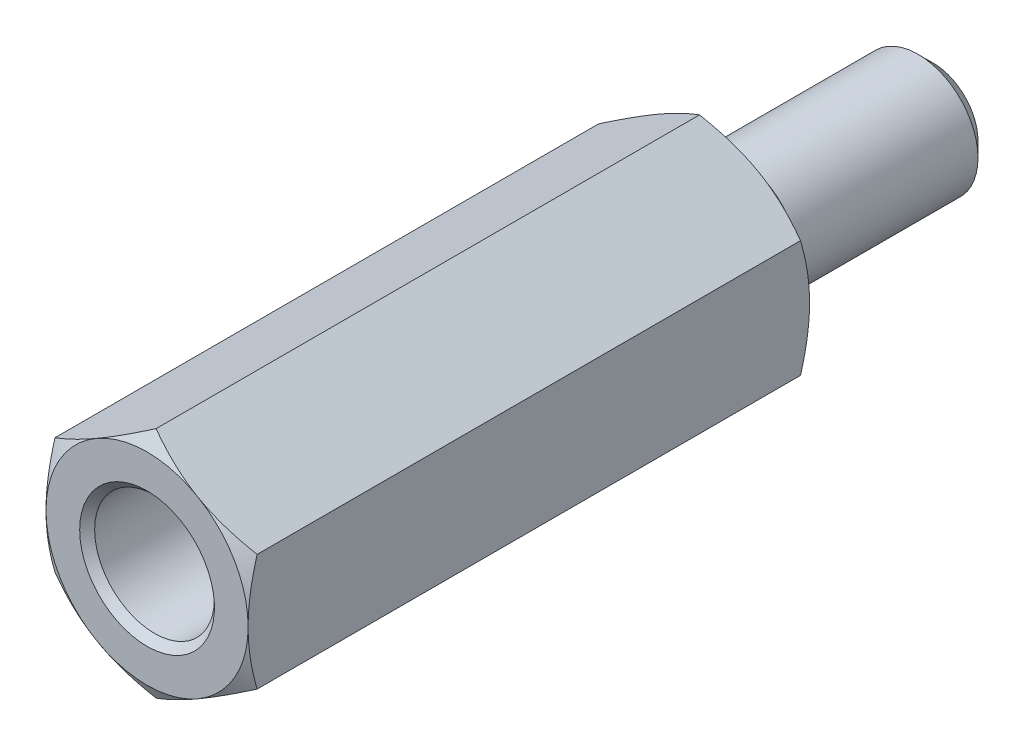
ISO-10303-21;
HEADER;
FILE_DESCRIPTION(('STEP AP214'),'2;1');
FILE_NAME('part.step','',(''),(''),'','','');
FILE_SCHEMA(('AUTOMOTIVE_DESIGN { 1 0 10303 214 1 1 1 1 }'));
ENDSEC;
DATA;
#1=APPLICATION_CONTEXT('core data for automotive mechanical design processes');
#2=APPLICATION_PROTOCOL_DEFINITION('international standard','automotive_design',2000,#1);
#3=PRODUCT_CONTEXT('',#1,'mechanical');
#4=PRODUCT('Part','Part','',(#3));
#5=PRODUCT_RELATED_PRODUCT_CATEGORY('part','',(#4));
#6=PRODUCT_DEFINITION_FORMATION('','',#4);
#7=PRODUCT_DEFINITION_CONTEXT('part definition',#1,'design');
#8=PRODUCT_DEFINITION('design','',#6,#7);
#9=PRODUCT_DEFINITION_SHAPE('','',#8);
#10=(LENGTH_UNIT() NAMED_UNIT(*) SI_UNIT(.MILLI.,.METRE.));
#11=(NAMED_UNIT(*) PLANE_ANGLE_UNIT() SI_UNIT($,.RADIAN.));
#12=(NAMED_UNIT(*) SI_UNIT($,.STERADIAN.) SOLID_ANGLE_UNIT());
#13=UNCERTAINTY_MEASURE_WITH_UNIT(LENGTH_MEASURE(1.E-05),#10,'distance_accuracy_value','');
#14=(GEOMETRIC_REPRESENTATION_CONTEXT(3) GLOBAL_UNCERTAINTY_ASSIGNED_CONTEXT((#13)) GLOBAL_UNIT_ASSIGNED_CONTEXT((#10,
#11,#12)) REPRESENTATION_CONTEXT('',''));
#15=CARTESIAN_POINT('',(0.,0.,0.));
#16=DIRECTION('',(0.,0.,1.));
#17=DIRECTION('',(1.,0.,0.));
#18=AXIS2_PLACEMENT_3D('',#15,#16,#17);
#19=CARTESIAN_POINT('',(16.,0.,0.));
#20=DIRECTION('',(0.,0.,-1.));
#21=DIRECTION('',(-1.,0.,0.));
#22=AXIS2_PLACEMENT_3D('',#19,#20,#21);
#23=PLANE('',#22);
#24=CARTESIAN_POINT('',(0.,0.,0.));
#25=DIRECTION('',(0.,0.,-1.));
#26=DIRECTION('',(-1.,0.,0.));
#27=AXIS2_PLACEMENT_3D('',#24,#25,#26);
#28=CIRCLE('',#27,13.5);
#29=CARTESIAN_POINT('',(-6.75,-11.6913429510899,0.));
#30=VERTEX_POINT('',#29);
#31=CARTESIAN_POINT('',(-13.5,0.,0.));
#32=VERTEX_POINT('',#31);
#33=EDGE_CURVE('E136',#30,#32,#28,.T.);
#34=ORIENTED_EDGE('',*,*,#33,.T.);
#35=CARTESIAN_POINT('',(-6.75,11.6913429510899,0.));
#36=VERTEX_POINT('',#35);
#37=EDGE_CURVE('E134',#32,#36,#28,.T.);
#38=ORIENTED_EDGE('',*,*,#37,.T.);
#39=CARTESIAN_POINT('',(6.75,11.6913429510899,0.));
#40=VERTEX_POINT('',#39);
#41=EDGE_CURVE('E113',#36,#40,#28,.T.);
#42=ORIENTED_EDGE('',*,*,#41,.T.);
#43=CARTESIAN_POINT('',(13.5,0.,0.));
#44=VERTEX_POINT('',#43);
#45=EDGE_CURVE('E103',#40,#44,#28,.T.);
#46=ORIENTED_EDGE('',*,*,#45,.T.);
#47=CARTESIAN_POINT('',(6.75,-11.6913429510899,0.));
#48=VERTEX_POINT('',#47);
#49=EDGE_CURVE('E29',#44,#48,#28,.T.);
#50=ORIENTED_EDGE('',*,*,#49,.T.);
#51=EDGE_CURVE('E37',#48,#30,#28,.T.);
#52=ORIENTED_EDGE('',*,*,#51,.T.);
#53=EDGE_LOOP('',(#34,#38,#42,#46,#50,#52));
#54=FACE_BOUND('',#53,.T.);
#55=CARTESIAN_POINT('',(0.,0.,0.));
#56=DIRECTION('',(0.,0.,1.));
#57=DIRECTION('',(1.,0.,0.));
#58=AXIS2_PLACEMENT_3D('',#55,#56,#57);
#59=CIRCLE('',#58,6.5);
#60=CARTESIAN_POINT('',(6.5,0.,0.));
#61=VERTEX_POINT('',#60);
#62=EDGE_CURVE('E252',#61,#61,#59,.T.);
#63=ORIENTED_EDGE('',*,*,#62,.T.);
#64=EDGE_LOOP('',(#63));
#65=FACE_BOUND('',#64,.T.);
#66=ADVANCED_FACE('F14',(#54,#65),#23,.T.);
#67=CARTESIAN_POINT('',(0.,0.,80.));
#68=DIRECTION('',(0.,0.,1.));
#69=DIRECTION('',(1.,0.,0.));
#70=AXIS2_PLACEMENT_3D('',#67,#68,#69);
#71=CYLINDRICAL_SURFACE('',#70,6.5);
#72=CARTESIAN_POINT('',(0.,0.,-4.));
#73=DIRECTION('',(0.,0.,1.));
#74=DIRECTION('',(1.,0.,0.));
#75=AXIS2_PLACEMENT_3D('',#72,#73,#74);
#76=CIRCLE('',#75,6.5);
#77=CARTESIAN_POINT('',(6.5,0.,-4.));
#78=VERTEX_POINT('',#77);
#79=EDGE_CURVE('E249',#78,#78,#76,.T.);
#80=ORIENTED_EDGE('',*,*,#79,.T.);
#81=EDGE_LOOP('',(#80));
#82=FACE_BOUND('',#81,.T.);
#83=ORIENTED_EDGE('',*,*,#62,.F.);
#84=EDGE_LOOP('',(#83));
#85=FACE_BOUND('',#84,.T.);
#86=ADVANCED_FACE('F331',(#82,#85),#71,.T.);
#87=CARTESIAN_POINT('',(6.5,0.,-4.));
#88=DIRECTION('',(0.,0.,1.));
#89=DIRECTION('',(1.,0.,0.));
#90=AXIS2_PLACEMENT_3D('',#87,#88,#89);
#91=PLANE('',#90);
#92=CARTESIAN_POINT('',(0.,0.,-4.));
#93=DIRECTION('',(0.,0.,1.));
#94=DIRECTION('',(1.,0.,0.));
#95=AXIS2_PLACEMENT_3D('',#92,#93,#94);
#96=CIRCLE('',#95,8.);
#97=CARTESIAN_POINT('',(8.,0.,-4.));
#98=VERTEX_POINT('',#97);
#99=EDGE_CURVE('E246',#98,#98,#96,.T.);
#100=ORIENTED_EDGE('',*,*,#99,.T.);
#101=EDGE_LOOP('',(#100));
#102=FACE_BOUND('',#101,.T.);
#103=ORIENTED_EDGE('',*,*,#79,.F.);
#104=EDGE_LOOP('',(#103));
#105=FACE_BOUND('',#104,.T.);
#106=ADVANCED_FACE('F336',(#102,#105),#91,.T.);
#107=CARTESIAN_POINT('',(0.,0.,80.));
#108=DIRECTION('',(0.,0.,1.));
#109=DIRECTION('',(1.,0.,0.));
#110=AXIS2_PLACEMENT_3D('',#107,#108,#109);
#111=CYLINDRICAL_SURFACE('',#110,8.);
#112=CARTESIAN_POINT('',(0.,0.,-28.));
#113=DIRECTION('',(0.,0.,1.));
#114=DIRECTION('',(1.,0.,0.));
#115=AXIS2_PLACEMENT_3D('',#112,#113,#114);
#116=CIRCLE('',#115,8.);
#117=CARTESIAN_POINT('',(8.,0.,-28.));
#118=VERTEX_POINT('',#117);
#119=EDGE_CURVE('E355',#118,#118,#116,.T.);
#120=ORIENTED_EDGE('',*,*,#119,.T.);
#121=EDGE_LOOP('',(#120));
#122=FACE_BOUND('',#121,.T.);
#123=ORIENTED_EDGE('',*,*,#99,.F.);
#124=EDGE_LOOP('',(#123));
#125=FACE_BOUND('',#124,.T.);
#126=ADVANCED_FACE('F415',(#122,#125),#111,.T.);
#127=CARTESIAN_POINT('',(0.,0.,-30.));
#128=DIRECTION('',(0.,0.,1.));
#129=DIRECTION('',(1.,0.,0.));
#130=AXIS2_PLACEMENT_3D('',#127,#128,#129);
#131=PLANE('',#130);
#132=CARTESIAN_POINT('',(0.,0.,-30.));
#133=DIRECTION('',(0.,0.,1.));
#134=DIRECTION('',(1.,0.,0.));
#135=AXIS2_PLACEMENT_3D('',#132,#133,#134);
#136=CIRCLE('',#135,6.);
#137=CARTESIAN_POINT('',(6.,0.,-30.));
#138=VERTEX_POINT('',#137);
#139=EDGE_CURVE('E352',#138,#138,#136,.F.);
#140=ORIENTED_EDGE('',*,*,#139,.T.);
#141=EDGE_LOOP('',(#140));
#142=FACE_BOUND('',#141,.T.);
#143=ADVANCED_FACE('F411',(#142),#131,.F.);
#144=CARTESIAN_POINT('',(0.,0.,3.76883238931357));
#145=DIRECTION('',(0.,0.,1.));
#146=DIRECTION('',(1.,0.,0.));
#147=AXIS2_PLACEMENT_3D('',#144,#145,#146);
#148=CONICAL_SURFACE('',#147,20.0278091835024,1.0471975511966);
#149=ORIENTED_EDGE('',*,*,#41,.F.);
#150=CARTESIAN_POINT('',(-13.5002,7.79411316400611,1.20583803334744));
#151=CARTESIAN_POINT('',(-13.2034751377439,7.96542734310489,1.10693600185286));
#152=CARTESIAN_POINT('',(-12.9055928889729,8.13740973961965,1.01252193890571));
#153=CARTESIAN_POINT('',(-12.3074397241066,8.48275363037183,0.833917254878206));
#154=CARTESIAN_POINT('',(-12.0071680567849,8.65611555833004,0.749729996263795));
#155=CARTESIAN_POINT('',(-11.403655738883,9.00455355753,0.592710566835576));
#156=CARTESIAN_POINT('',(-11.1004098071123,9.17963267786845,0.519905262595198));
#157=CARTESIAN_POINT('',(-10.4918107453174,9.53100751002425,0.387213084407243));
#158=CARTESIAN_POINT('',(-10.1864577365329,9.70730315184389,0.327325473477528));
#159=CARTESIAN_POINT('',(-9.58146884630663,10.0565936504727,0.223015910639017));
#160=CARTESIAN_POINT('',(-9.28187788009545,10.2295625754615,0.178248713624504));
#161=CARTESIAN_POINT('',(-8.68132315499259,10.5762930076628,0.103183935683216));
#162=CARTESIAN_POINT('',(-8.38035936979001,10.7500545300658,0.0728866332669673));
#163=CARTESIAN_POINT('',(-7.77792621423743,11.0978694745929,0.0275266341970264));
#164=CARTESIAN_POINT('',(-7.47645787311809,11.2719223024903,0.0124458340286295));
#165=CARTESIAN_POINT('',(-6.87324289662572,11.6201886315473,-0.0021568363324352));
#166=CARTESIAN_POINT('',(-6.57149627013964,11.7944021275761,-0.00167918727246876));
#167=CARTESIAN_POINT('',(-6.00738189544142,12.1200937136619,0.0137483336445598));
#168=CARTESIAN_POINT('',(-5.74497394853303,12.2715950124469,0.026816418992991));
#169=CARTESIAN_POINT('',(-5.22076165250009,12.5742491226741,0.0644725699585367));
#170=CARTESIAN_POINT('',(-4.9589573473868,12.7254019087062,0.0890614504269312));
#171=CARTESIAN_POINT('',(-4.43609453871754,13.0272768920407,0.149330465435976));
#172=CARTESIAN_POINT('',(-4.17503683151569,13.1779986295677,0.185019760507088));
#173=CARTESIAN_POINT('',(-3.65414530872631,13.4787354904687,0.266863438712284));
#174=CARTESIAN_POINT('',(-3.39431157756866,13.6287505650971,0.313018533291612));
#175=CARTESIAN_POINT('',(-2.60557180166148,14.0841296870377,0.468349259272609));
#176=CARTESIAN_POINT('',(-2.07894982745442,14.3881750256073,0.59301303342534));
#177=CARTESIAN_POINT('',(-1.03355849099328,14.9917319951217,0.875948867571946));
#178=CARTESIAN_POINT('',(-0.514775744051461,15.2912513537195,1.03415447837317));
#179=CARTESIAN_POINT('',(0.000200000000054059,15.5885727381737,1.20583803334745));
#180=B_SPLINE_CURVE_WITH_KNOTS('',3,(#150,#151,#152,#153,#154,#155,#156,#157,#158,#159,#160,
#161,#162,#163,#164,#165,#166,#167,#168,#169,#170,#171,#172,#173,#174,#175,#176,#177,#178,#179),
.UNSPECIFIED.,.F.,.F.,(4,2,2,2,2,2,2,2,2,2,2,2,2,2,4),(0.,1.06987949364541,2.14010980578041,
3.21282939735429,4.28548777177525,5.33167033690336,6.37787303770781,7.42282956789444,
8.46775380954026,9.377387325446,10.2870851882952,11.1975357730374,12.1080482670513,
13.9691139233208,15.8265265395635),.UNSPECIFIED.);
#181=CARTESIAN_POINT('',(0.,15.5884572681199,1.20577136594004));
#182=VERTEX_POINT('',#181);
#183=EDGE_CURVE('E121',#36,#182,#180,.T.);
#184=ORIENTED_EDGE('',*,*,#183,.T.);
#185=CARTESIAN_POINT('',(13.5002,7.79411316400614,1.20583803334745));
#186=CARTESIAN_POINT('',(13.2034751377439,7.96542734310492,1.10693600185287));
#187=CARTESIAN_POINT('',(12.9055928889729,8.13740973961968,1.01252193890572));
#188=CARTESIAN_POINT('',(12.3074397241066,8.48275363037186,0.833917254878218));
#189=CARTESIAN_POINT('',(12.0071680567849,8.65611555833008,0.749729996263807));
#190=CARTESIAN_POINT('',(11.403655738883,9.00455355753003,0.59271056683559));
#191=CARTESIAN_POINT('',(11.1004098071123,9.17963267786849,0.519905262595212));
#192=CARTESIAN_POINT('',(10.4918107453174,9.53100751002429,0.387213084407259));
#193=CARTESIAN_POINT('',(10.1864577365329,9.70730315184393,0.327325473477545));
#194=CARTESIAN_POINT('',(9.58146884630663,10.0565936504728,0.223015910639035));
#195=CARTESIAN_POINT('',(9.28187788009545,10.2295625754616,0.178248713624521));
#196=CARTESIAN_POINT('',(8.68132315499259,10.5762930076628,0.103183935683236));
#197=CARTESIAN_POINT('',(8.38035936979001,10.7500545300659,0.0728866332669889));
#198=CARTESIAN_POINT('',(7.77792621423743,11.0978694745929,0.0275266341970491));
#199=CARTESIAN_POINT('',(7.47645787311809,11.2719223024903,0.0124458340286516));
#200=CARTESIAN_POINT('',(6.87324289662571,11.6201886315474,-0.0021568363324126));
#201=CARTESIAN_POINT('',(6.57149627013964,11.7944021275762,-0.00167918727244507));
#202=CARTESIAN_POINT('',(6.00738189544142,12.1200937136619,0.0137483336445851));
#203=CARTESIAN_POINT('',(5.74497394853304,12.271595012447,0.0268164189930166));
#204=CARTESIAN_POINT('',(5.22076165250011,12.5742491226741,0.0644725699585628));
#205=CARTESIAN_POINT('',(4.95895734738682,12.7254019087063,0.0890614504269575));
#206=CARTESIAN_POINT('',(4.43609453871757,13.0272768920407,0.149330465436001));
#207=CARTESIAN_POINT('',(4.17503683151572,13.1779986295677,0.185019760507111));
#208=CARTESIAN_POINT('',(3.65414530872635,13.4787354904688,0.266863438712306));
#209=CARTESIAN_POINT('',(3.3943115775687,13.6287505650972,0.313018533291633));
#210=CARTESIAN_POINT('',(2.60557180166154,14.0841296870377,0.468349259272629));
#211=CARTESIAN_POINT('',(2.07894982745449,14.3881750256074,0.593013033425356));
#212=CARTESIAN_POINT('',(1.03355849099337,14.9917319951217,0.875948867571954));
#213=CARTESIAN_POINT('',(0.514775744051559,15.2912513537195,1.03415447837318));
#214=CARTESIAN_POINT('',(-0.000199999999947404,15.5885727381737,1.20583803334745));
#215=B_SPLINE_CURVE_WITH_KNOTS('',3,(#185,#186,#187,#188,#189,#190,#191,#192,#193,#194,#195,
#196,#197,#198,#199,#200,#201,#202,#203,#204,#205,#206,#207,#208,#209,#210,#211,#212,#213,#214),
.UNSPECIFIED.,.F.,.F.,(4,2,2,2,2,2,2,2,2,2,2,2,2,2,4),(0.,1.06987949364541,2.14010980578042,
3.21282939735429,4.28548777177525,5.33167033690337,6.37787303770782,7.42282956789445,
8.46775380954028,9.377387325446,10.2870851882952,11.1975357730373,12.1080482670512,
13.9691139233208,15.8265265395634),.UNSPECIFIED.);
#216=EDGE_CURVE('E118',#40,#182,#215,.T.);
#217=ORIENTED_EDGE('',*,*,#216,.F.);
#218=EDGE_LOOP('',(#149,#184,#217));
#219=FACE_BOUND('',#218,.T.);
#220=ADVANCED_FACE('F119',(#219),#148,.T.);
#221=CARTESIAN_POINT('',(-13.5,-21.0290661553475,6.63342563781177));
#222=CARTESIAN_POINT('',(-13.5,-20.7338743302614,6.49000924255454));
#223=CARTESIAN_POINT('',(-13.5,-20.4383386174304,6.34730100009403));
#224=CARTESIAN_POINT('',(-13.5,-19.8465076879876,6.06346101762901));
#225=CARTESIAN_POINT('',(-13.5,-19.5502124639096,5.92232929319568));
#226=CARTESIAN_POINT('',(-13.5,-18.6600023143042,5.50150259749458));
#227=CARTESIAN_POINT('',(-13.5,-18.0648487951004,5.22441794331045));
#228=CARTESIAN_POINT('',(-13.5,-16.8673953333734,4.67739532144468));
#229=CARTESIAN_POINT('',(-13.5,-16.2650741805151,4.40750367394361));
#230=CARTESIAN_POINT('',(-13.5,-15.0556744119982,3.87863708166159));
#231=CARTESIAN_POINT('',(-13.5,-14.4485960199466,3.61966162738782));
#232=CARTESIAN_POINT('',(-13.5,-13.2087369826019,3.10725595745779));
#233=CARTESIAN_POINT('',(-13.5,-12.5757655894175,2.85428490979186));
#234=CARTESIAN_POINT('',(-13.5,-11.3024472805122,2.36726382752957));
#235=CARTESIAN_POINT('',(-13.5,-10.6620995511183,2.13321590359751));
#236=CARTESIAN_POINT('',(-13.5,-9.37419945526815,1.69012115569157));
#237=CARTESIAN_POINT('',(-13.5,-8.72666436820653,1.48102450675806));
#238=CARTESIAN_POINT('',(-13.5,-7.42224458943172,1.09446842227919));
#239=CARTESIAN_POINT('',(-13.5,-6.76536288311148,0.916999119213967));
#240=CARTESIAN_POINT('',(-13.5,-5.77473742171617,0.681380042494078));
#241=CARTESIAN_POINT('',(-13.5,-5.44457124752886,0.608099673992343));
#242=CARTESIAN_POINT('',(-13.5,-4.78196574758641,0.472596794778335));
#243=CARTESIAN_POINT('',(-13.5,-4.44952646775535,0.410374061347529));
#244=CARTESIAN_POINT('',(-13.5,-3.78259710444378,0.298078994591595));
#245=CARTESIAN_POINT('',(-13.5,-3.44810705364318,0.248006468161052));
#246=CARTESIAN_POINT('',(-13.5,-2.77742306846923,0.161007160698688));
#247=CARTESIAN_POINT('',(-13.5,-2.44122920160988,0.124079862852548));
#248=CARTESIAN_POINT('',(-13.5,-1.77203703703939,0.0645727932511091));
#249=CARTESIAN_POINT('',(-13.5,-1.43905510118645,0.0418101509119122));
#250=CARTESIAN_POINT('',(-13.5,-0.772427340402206,0.0103917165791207));
#251=CARTESIAN_POINT('',(-13.5,-0.438781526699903,0.00173568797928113));
#252=CARTESIAN_POINT('',(-13.5,0.228577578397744,-0.00126327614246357));
#253=CARTESIAN_POINT('',(-13.5,0.562290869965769,0.00439382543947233));
#254=CARTESIAN_POINT('',(-13.5,1.2291795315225,0.029881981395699));
#255=CARTESIAN_POINT('',(-13.5,1.56235487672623,0.0497136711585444));
#256=CARTESIAN_POINT('',(-13.5,2.36028988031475,0.113760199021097));
#257=CARTESIAN_POINT('',(-13.5,2.8245316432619,0.164545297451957));
#258=CARTESIAN_POINT('',(-13.5,3.74963335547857,0.29089186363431));
#259=CARTESIAN_POINT('',(-13.5,4.21049284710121,0.366456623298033));
#260=CARTESIAN_POINT('',(-13.5,5.12836924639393,0.539674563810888));
#261=CARTESIAN_POINT('',(-13.5,5.5853829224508,0.637344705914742));
#262=CARTESIAN_POINT('',(-13.5,6.49485704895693,0.851787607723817));
#263=CARTESIAN_POINT('',(-13.5,6.94731756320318,0.96856009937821));
#264=CARTESIAN_POINT('',(-13.5,7.85767929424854,1.22113264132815));
#265=CARTESIAN_POINT('',(-13.5,8.31547867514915,1.3572972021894));
#266=CARTESIAN_POINT('',(-13.5,9.22656897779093,1.64387916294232));
#267=CARTESIAN_POINT('',(-13.5,9.67985986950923,1.79429665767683));
#268=CARTESIAN_POINT('',(-13.5,10.5821538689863,2.10698012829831));
#269=CARTESIAN_POINT('',(-13.5,11.0311583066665,2.26924228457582));
#270=CARTESIAN_POINT('',(-13.5,11.9254345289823,2.60368810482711));
#271=CARTESIAN_POINT('',(-13.5,12.3707063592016,2.7758716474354));
#272=CARTESIAN_POINT('',(-13.5,13.4284138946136,3.19627680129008));
#273=CARTESIAN_POINT('',(-13.5,14.0393389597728,3.44829352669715));
#274=CARTESIAN_POINT('',(-13.5,15.2559160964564,3.96478515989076));
#275=CARTESIAN_POINT('',(-13.5,15.8615678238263,4.22926087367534));
#276=CARTESIAN_POINT('',(-13.5,17.06859042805,4.76815397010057));
#277=CARTESIAN_POINT('',(-13.5,17.6699602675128,5.04257367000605));
#278=CARTESIAN_POINT('',(-13.5,18.8689981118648,5.59932983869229));
#279=CARTESIAN_POINT('',(-13.5,19.4666661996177,5.88166612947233));
#280=CARTESIAN_POINT('',(-13.5,20.6595957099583,6.4530861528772));
#281=CARTESIAN_POINT('',(-13.5,21.2548536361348,6.74217717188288));
#282=CARTESIAN_POINT('',(-13.5,22.4427777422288,7.3256352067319));
#283=CARTESIAN_POINT('',(-13.5,23.03544391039,7.62000224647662));
#284=CARTESIAN_POINT('',(-13.5,24.2185060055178,8.21306061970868));
#285=CARTESIAN_POINT('',(-13.5,24.8089022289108,8.51175136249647));
#286=CARTESIAN_POINT('',(-13.5,25.9878347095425,9.11278322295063));
#287=CARTESIAN_POINT('',(-13.5,26.5763709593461,9.41512435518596));
#288=CARTESIAN_POINT('',(-13.5,28.2395224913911,10.2749971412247));
#289=CARTESIAN_POINT('',(-13.5,29.3122791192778,10.8361236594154));
#290=CARTESIAN_POINT('',(-13.5,31.4537975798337,11.9660258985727));
#291=CARTESIAN_POINT('',(-13.5,32.5225592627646,12.5348019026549));
#292=CARTESIAN_POINT('',(-13.5,34.6542067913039,13.6767324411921));
#293=CARTESIAN_POINT('',(-13.5,35.7171006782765,14.2498719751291));
#294=CARTESIAN_POINT('',(-13.5,37.3095606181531,15.1129757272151));
#295=CARTESIAN_POINT('',(-13.5,37.8400523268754,15.4012346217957));
#296=CARTESIAN_POINT('',(-13.5,38.9004803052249,15.9787703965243));
#297=CARTESIAN_POINT('',(-13.5,39.4304165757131,16.2680472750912));
#298=CARTESIAN_POINT('',(-13.5,39.9601067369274,16.5577742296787));
#299=B_SPLINE_CURVE_WITH_KNOTS('',3,(#221,#222,#223,#224,#225,#226,#227,#228,#229,#230,#231,
#232,#233,#234,#235,#236,#237,#238,#239,#240,#241,#242,#243,#244,#245,#246,#247,#248,#249,#250,
#251,#252,#253,#254,#255,#256,#257,#258,#259,#260,#261,#262,#263,#264,#265,#266,#267,#268,#269,
#270,#271,#272,#273,#274,#275,#276,#277,#278,#279,#280,#281,#282,#283,#284,#285,#286,#287,#288,
#289,#290,#291,#292,#293,#294,#295,#296,#297,#298),.UNSPECIFIED.,.F.,.F.,(4,2,2,2,2,2,2,2,2,2,2,
2,2,2,2,2,2,2,2,2,2,2,2,2,2,2,2,2,2,2,2,2,2,2,2,2,2,2,4),(0.,0.98455819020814,1.96912609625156,
3.93854849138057,5.91853738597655,7.89843376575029,9.94315363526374,11.9881012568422,
14.0288944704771,16.0690498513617,17.083496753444,18.0979232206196,19.1123335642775,
20.1267040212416,21.1276910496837,22.1286612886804,23.1296341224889,24.1306518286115,
25.5309129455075,26.9313601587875,28.3328855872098,29.7343913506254,31.1669750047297,
32.599568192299,34.0317014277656,35.4638171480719,37.4462219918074,39.4287552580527,
41.4117535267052,43.3947072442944,45.3799089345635,47.365119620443,49.3500616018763,
51.335011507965,54.9669101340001,58.5989435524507,62.2216471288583,64.0328977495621,
65.844145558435),.UNSPECIFIED.);
#300=CARTESIAN_POINT('',(-13.5,7.79422863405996,1.20577136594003));
#301=VERTEX_POINT('',#300);
#302=EDGE_CURVE('E135',#32,#301,#299,.T.);
#303=ORIENTED_EDGE('',*,*,#302,.T.);
#304=EDGE_CURVE('E262',#301,#36,#180,.T.);
#305=ORIENTED_EDGE('',*,*,#304,.T.);
#306=ORIENTED_EDGE('',*,*,#37,.F.);
#307=EDGE_LOOP('',(#303,#305,#306));
#308=FACE_BOUND('',#307,.T.);
#309=ADVANCED_FACE('F154',(#308),#148,.T.);
#310=CARTESIAN_POINT('',(-13.5,-7.79422863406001,1.20577136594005));
#311=VERTEX_POINT('',#310);
#312=EDGE_CURVE('E145',#311,#32,#299,.T.);
#313=ORIENTED_EDGE('',*,*,#312,.T.);
#314=ORIENTED_EDGE('',*,*,#33,.F.);
#315=CARTESIAN_POINT('',(-13.5002,-7.79411316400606,1.20583803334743));
#316=CARTESIAN_POINT('',(-13.203475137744,-7.96542734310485,1.10693600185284));
#317=CARTESIAN_POINT('',(-12.9055928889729,-8.1374097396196,1.01252193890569));
#318=CARTESIAN_POINT('',(-12.3074397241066,-8.48275363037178,0.833917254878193));
#319=CARTESIAN_POINT('',(-12.0071680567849,-8.65611555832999,0.749729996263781));
#320=CARTESIAN_POINT('',(-11.403655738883,-9.00455355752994,0.592710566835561));
#321=CARTESIAN_POINT('',(-11.1004098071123,-9.1796326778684,0.519905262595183));
#322=CARTESIAN_POINT('',(-10.4918107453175,-9.5310075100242,0.387213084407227));
#323=CARTESIAN_POINT('',(-10.1864577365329,-9.70730315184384,0.327325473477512));
#324=CARTESIAN_POINT('',(-9.58146884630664,-10.0565936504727,0.223015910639));
#325=CARTESIAN_POINT('',(-9.28187788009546,-10.2295625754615,0.178248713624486));
#326=CARTESIAN_POINT('',(-8.68132315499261,-10.5762930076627,0.103183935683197));
#327=CARTESIAN_POINT('',(-8.38035936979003,-10.7500545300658,0.0728866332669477));
#328=CARTESIAN_POINT('',(-7.77792621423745,-11.0978694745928,0.0275266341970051));
#329=CARTESIAN_POINT('',(-7.47645787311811,-11.2719223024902,0.0124458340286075));
#330=CARTESIAN_POINT('',(-6.87324289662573,-11.6201886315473,-0.0021568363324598));
#331=CARTESIAN_POINT('',(-6.57149627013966,-11.7944021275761,-0.00167918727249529));
#332=CARTESIAN_POINT('',(-6.00738189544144,-12.1200937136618,0.0137483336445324));
#333=CARTESIAN_POINT('',(-5.74497394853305,-12.2715950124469,0.0268164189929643));
#334=CARTESIAN_POINT('',(-5.22076165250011,-12.574249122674,0.0644725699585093));
#335=CARTESIAN_POINT('',(-4.95895734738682,-12.7254019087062,0.0890614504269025));
#336=CARTESIAN_POINT('',(-4.43609453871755,-13.0272768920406,0.149330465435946));
#337=CARTESIAN_POINT('',(-4.1750368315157,-13.1779986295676,0.185019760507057));
#338=CARTESIAN_POINT('',(-3.65414530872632,-13.4787354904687,0.266863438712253));
#339=CARTESIAN_POINT('',(-3.39431157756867,-13.6287505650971,0.313018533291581));
#340=CARTESIAN_POINT('',(-2.60557180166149,-14.0841296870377,0.468349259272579));
#341=CARTESIAN_POINT('',(-2.07894982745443,-14.3881750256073,0.593013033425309));
#342=CARTESIAN_POINT('',(-1.03355849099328,-14.9917319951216,0.875948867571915));
#343=CARTESIAN_POINT('',(-0.514775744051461,-15.2912513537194,1.03415447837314));
#344=CARTESIAN_POINT('',(0.000200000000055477,-15.5885727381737,1.20583803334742));
#345=B_SPLINE_CURVE_WITH_KNOTS('',3,(#315,#316,#317,#318,#319,#320,#321,#322,#323,#324,#325,
#326,#327,#328,#329,#330,#331,#332,#333,#334,#335,#336,#337,#338,#339,#340,#341,#342,#343,#344),
.UNSPECIFIED.,.F.,.F.,(4,2,2,2,2,2,2,2,2,2,2,2,2,2,4),(0.,1.0698794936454,2.14010980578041,
3.21282939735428,4.28548777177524,5.33167033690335,6.37787303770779,7.42282956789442,
8.46775380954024,9.37738732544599,10.2870851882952,11.1975357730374,12.1080482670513,
13.9691139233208,15.8265265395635),.UNSPECIFIED.);
#346=EDGE_CURVE('E124',#311,#30,#345,.T.);
#347=ORIENTED_EDGE('',*,*,#346,.F.);
#348=EDGE_LOOP('',(#313,#314,#347));
#349=FACE_BOUND('',#348,.T.);
#350=ADVANCED_FACE('F158',(#349),#148,.T.);
#351=CARTESIAN_POINT('',(13.5002,-7.79411316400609,1.20583803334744));
#352=CARTESIAN_POINT('',(13.203475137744,-7.96542734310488,1.10693600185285));
#353=CARTESIAN_POINT('',(12.9055928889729,-8.13740973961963,1.0125219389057));
#354=CARTESIAN_POINT('',(12.3074397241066,-8.48275363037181,0.833917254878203));
#355=CARTESIAN_POINT('',(12.0071680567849,-8.65611555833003,0.749729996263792));
#356=CARTESIAN_POINT('',(11.403655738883,-9.00455355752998,0.592710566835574));
#357=CARTESIAN_POINT('',(11.1004098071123,-9.17963267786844,0.519905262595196));
#358=CARTESIAN_POINT('',(10.4918107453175,-9.53100751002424,0.387213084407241));
#359=CARTESIAN_POINT('',(10.1864577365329,-9.70730315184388,0.327325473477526));
#360=CARTESIAN_POINT('',(9.58146884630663,-10.0565936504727,0.223015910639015));
#361=CARTESIAN_POINT('',(9.28187788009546,-10.2295625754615,0.178248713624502));
#362=CARTESIAN_POINT('',(8.6813231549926,-10.5762930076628,0.103183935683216));
#363=CARTESIAN_POINT('',(8.38035936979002,-10.7500545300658,0.0728866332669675));
#364=CARTESIAN_POINT('',(7.77792621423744,-11.0978694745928,0.0275266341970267));
#365=CARTESIAN_POINT('',(7.4764578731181,-11.2719223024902,0.0124458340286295));
#366=CARTESIAN_POINT('',(6.87324289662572,-11.6201886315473,-0.0021568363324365));
#367=CARTESIAN_POINT('',(6.57149627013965,-11.7944021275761,-0.00167918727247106));
#368=CARTESIAN_POINT('',(6.00738189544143,-12.1200937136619,0.0137483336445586));
#369=CARTESIAN_POINT('',(5.74497394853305,-12.2715950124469,0.0268164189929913));
#370=CARTESIAN_POINT('',(5.22076165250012,-12.5742491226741,0.0644725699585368));
#371=CARTESIAN_POINT('',(4.95895734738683,-12.7254019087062,0.0890614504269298));
#372=CARTESIAN_POINT('',(4.43609453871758,-13.0272768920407,0.149330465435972));
#373=CARTESIAN_POINT('',(4.17503683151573,-13.1779986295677,0.185019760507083));
#374=CARTESIAN_POINT('',(3.65414530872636,-13.4787354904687,0.266863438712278));
#375=CARTESIAN_POINT('',(3.39431157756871,-13.6287505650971,0.313018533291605));
#376=CARTESIAN_POINT('',(2.60557180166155,-14.0841296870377,0.468349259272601));
#377=CARTESIAN_POINT('',(2.0789498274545,-14.3881750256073,0.593013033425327));
#378=CARTESIAN_POINT('',(1.03355849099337,-14.9917319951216,0.875948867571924));
#379=CARTESIAN_POINT('',(0.514775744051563,-15.2912513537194,1.03415447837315));
#380=CARTESIAN_POINT('',(-0.000199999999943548,-15.5885727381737,1.20583803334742));
#381=B_SPLINE_CURVE_WITH_KNOTS('',3,(#351,#352,#353,#354,#355,#356,#357,#358,#359,#360,#361,
#362,#363,#364,#365,#366,#367,#368,#369,#370,#371,#372,#373,#374,#375,#376,#377,#378,#379,#380),
.UNSPECIFIED.,.F.,.F.,(4,2,2,2,2,2,2,2,2,2,2,2,2,2,4),(0.,1.06987949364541,2.14010980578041,
3.21282939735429,4.28548777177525,5.33167033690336,6.37787303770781,7.42282956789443,
8.46775380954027,9.37738732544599,10.2870851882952,11.1975357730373,12.1080482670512,
13.9691139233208,15.8265265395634),.UNSPECIFIED.);
#382=CARTESIAN_POINT('',(0.,-15.5884572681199,1.20577136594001));
#383=VERTEX_POINT('',#382);
#384=EDGE_CURVE('E184',#48,#383,#381,.T.);
#385=ORIENTED_EDGE('',*,*,#384,.T.);
#386=EDGE_CURVE('E130',#30,#383,#345,.T.);
#387=ORIENTED_EDGE('',*,*,#386,.F.);
#388=ORIENTED_EDGE('',*,*,#51,.F.);
#389=EDGE_LOOP('',(#385,#387,#388));
#390=FACE_BOUND('',#389,.T.);
#391=ADVANCED_FACE('F161',(#390),#148,.T.);
#392=CARTESIAN_POINT('',(13.5,-7.79422863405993,1.20577136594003));
#393=VERTEX_POINT('',#392);
#394=EDGE_CURVE('E190',#393,#48,#381,.T.);
#395=ORIENTED_EDGE('',*,*,#394,.T.);
#396=ORIENTED_EDGE('',*,*,#49,.F.);
#397=CARTESIAN_POINT('',(13.5,-21.029066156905,6.63342563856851));
#398=CARTESIAN_POINT('',(13.5,-20.7338743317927,6.49000924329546));
#399=CARTESIAN_POINT('',(13.5,-20.4383386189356,6.34730100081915));
#400=CARTESIAN_POINT('',(13.5,-19.8465076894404,6.06346101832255));
#401=CARTESIAN_POINT('',(13.5,-19.5502124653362,5.92232929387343));
#402=CARTESIAN_POINT('',(13.5,-18.6600023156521,5.50150259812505));
#403=CARTESIAN_POINT('',(13.5,-18.0648487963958,5.22441794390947));
#404=CARTESIAN_POINT('',(13.5,-16.8673953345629,4.67739532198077));
#405=CARTESIAN_POINT('',(13.5,-16.2650741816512,4.40750367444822));
#406=CARTESIAN_POINT('',(13.5,-15.0556744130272,3.87863708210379));
#407=CARTESIAN_POINT('',(13.5,-14.4485960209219,3.61966162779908));
#408=CARTESIAN_POINT('',(13.5,-13.2087369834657,3.10725595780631));
#409=CARTESIAN_POINT('',(13.5,-12.5757655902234,2.85428491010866));
#410=CARTESIAN_POINT('',(13.5,-11.3024472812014,2.36726382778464));
#411=CARTESIAN_POINT('',(13.5,-10.6620995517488,2.13321590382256));
#412=CARTESIAN_POINT('',(13.5,-9.37419945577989,1.6901211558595));
#413=CARTESIAN_POINT('',(13.5,-8.72666436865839,1.48102450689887));
#414=CARTESIAN_POINT('',(13.5,-7.42224458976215,1.09446842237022));
#415=CARTESIAN_POINT('',(13.5,-6.76536288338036,0.916999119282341));
#416=CARTESIAN_POINT('',(13.5,-5.77473742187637,0.681380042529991));
#417=CARTESIAN_POINT('',(13.5,-5.44457124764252,0.608099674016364));
#418=CARTESIAN_POINT('',(13.5,-4.78196574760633,0.472596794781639));
#419=CARTESIAN_POINT('',(13.5,-4.44952646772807,0.410374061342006));
#420=CARTESIAN_POINT('',(13.5,-3.78259710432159,0.298078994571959));
#421=CARTESIAN_POINT('',(13.5,-3.44810705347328,0.248006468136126));
#422=CARTESIAN_POINT('',(13.5,-2.77742306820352,0.161007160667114));
#423=CARTESIAN_POINT('',(13.5,-2.44122920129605,0.124079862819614));
#424=CARTESIAN_POINT('',(13.5,-1.77203703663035,0.0645727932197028));
#425=CARTESIAN_POINT('',(13.5,-1.43905510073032,0.0418101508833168));
#426=CARTESIAN_POINT('',(13.5,-0.772427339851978,0.0103917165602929));
#427=CARTESIAN_POINT('',(13.5,-0.438781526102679,0.00173568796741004));
#428=CARTESIAN_POINT('',(13.5,0.228577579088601,-0.00126327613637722));
#429=CARTESIAN_POINT('',(13.5,0.562290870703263,0.00439382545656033));
#430=CARTESIAN_POINT('',(13.5,1.22917953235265,0.0298819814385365));
#431=CARTESIAN_POINT('',(13.5,1.56235487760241,0.0497136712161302));
#432=CARTESIAN_POINT('',(13.5,2.36028988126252,0.113760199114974));
#433=CARTESIAN_POINT('',(13.5,2.82453164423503,0.164545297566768));
#434=CARTESIAN_POINT('',(13.5,3.74963335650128,0.290891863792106));
#435=CARTESIAN_POINT('',(13.5,4.21049284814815,0.36645662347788));
#436=CARTESIAN_POINT('',(13.5,5.12836924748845,0.53967456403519));
#437=CARTESIAN_POINT('',(13.5,5.58538292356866,0.637344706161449));
#438=CARTESIAN_POINT('',(13.5,6.49485705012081,0.851787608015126));
#439=CARTESIAN_POINT('',(13.5,6.94731756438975,0.968560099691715));
#440=CARTESIAN_POINT('',(13.5,7.85767929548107,1.22113264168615));
#441=CARTESIAN_POINT('',(13.5,8.31547867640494,1.35729720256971));
#442=CARTESIAN_POINT('',(13.5,9.22656897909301,1.64387916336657));
#443=CARTESIAN_POINT('',(13.5,9.67985987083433,1.79429665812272));
#444=CARTESIAN_POINT('',(13.5,10.5821538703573,2.10698012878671));
#445=CARTESIAN_POINT('',(13.5,11.0311583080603,2.26924228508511));
#446=CARTESIAN_POINT('',(13.5,11.9254345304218,2.60368810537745));
#447=CARTESIAN_POINT('',(13.5,12.370706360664,2.77587164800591));
#448=CARTESIAN_POINT('',(13.5,13.4284138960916,3.19627680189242));
#449=CARTESIAN_POINT('',(13.5,14.0393389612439,3.44829352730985));
#450=CARTESIAN_POINT('',(13.5,15.2559160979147,3.9647851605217));
#451=CARTESIAN_POINT('',(13.5,15.8615678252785,4.22926087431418));
#452=CARTESIAN_POINT('',(13.5,17.0685904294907,4.76815397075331));
#453=CARTESIAN_POINT('',(13.5,17.6699602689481,5.0425736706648));
#454=CARTESIAN_POINT('',(13.5,18.8689981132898,5.59932983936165));
#455=CARTESIAN_POINT('',(13.5,19.4666662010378,5.88166613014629));
#456=CARTESIAN_POINT('',(13.5,20.6595957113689,6.45308615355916));
#457=CARTESIAN_POINT('',(13.5,21.2548536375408,6.74217717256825));
#458=CARTESIAN_POINT('',(13.5,22.4427777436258,7.32563520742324));
#459=CARTESIAN_POINT('',(13.5,23.0354439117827,7.62000224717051));
#460=CARTESIAN_POINT('',(13.5,24.2185060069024,8.21306062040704));
#461=CARTESIAN_POINT('',(13.5,24.8089022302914,8.51175136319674));
#462=CARTESIAN_POINT('',(13.5,25.9878347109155,9.1127832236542));
#463=CARTESIAN_POINT('',(13.5,26.5763709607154,9.4151243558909));
#464=CARTESIAN_POINT('',(13.5,28.2395224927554,10.2749971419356));
#465=CARTESIAN_POINT('',(13.5,29.312279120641,10.8361236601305));
#466=CARTESIAN_POINT('',(13.5,31.4537975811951,11.9660258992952));
#467=CARTESIAN_POINT('',(13.5,32.5225592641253,12.5348019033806));
#468=CARTESIAN_POINT('',(13.5,34.6542067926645,13.6767324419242));
#469=CARTESIAN_POINT('',(13.5,35.7171006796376,14.2498719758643));
#470=CARTESIAN_POINT('',(13.5,37.3095606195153,15.1129757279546));
#471=CARTESIAN_POINT('',(13.5,37.8400523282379,15.4012346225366));
#472=CARTESIAN_POINT('',(13.5,38.9004803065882,15.9787703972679));
#473=CARTESIAN_POINT('',(13.5,39.4304165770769,16.2680472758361));
#474=CARTESIAN_POINT('',(13.5,39.9601067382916,16.5577742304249));
#475=B_SPLINE_CURVE_WITH_KNOTS('',3,(#397,#398,#399,#400,#401,#402,#403,#404,#405,#406,#407,
#408,#409,#410,#411,#412,#413,#414,#415,#416,#417,#418,#419,#420,#421,#422,#423,#424,#425,#426,
#427,#428,#429,#430,#431,#432,#433,#434,#435,#436,#437,#438,#439,#440,#441,#442,#443,#444,#445,
#446,#447,#448,#449,#450,#451,#452,#453,#454,#455,#456,#457,#458,#459,#460,#461,#462,#463,#464,
#465,#466,#467,#468,#469,#470,#471,#472,#473,#474),.UNSPECIFIED.,.F.,.F.,(4,2,2,2,2,2,2,2,2,2,2,
2,2,2,2,2,2,2,2,2,2,2,2,2,2,2,2,2,2,2,2,2,2,2,2,2,2,2,4),(0.,0.984558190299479,1.96912609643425,
3.93854849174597,5.91853738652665,7.89843376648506,9.943153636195,11.98810125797,
14.0288944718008,16.0690498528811,17.0834967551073,18.0979232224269,19.1123335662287,
20.1267040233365,21.1276910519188,22.1286612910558,23.1296341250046,24.1306518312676,
25.5309129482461,26.9313601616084,28.3328855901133,29.7343913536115,31.1669750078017,
32.599568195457,34.0317014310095,35.4638171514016,37.44622199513,39.4287552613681,
41.4117535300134,43.3947072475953,45.3799089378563,47.3651196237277,49.3500616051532,
51.3350115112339,54.9669101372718,58.5989435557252,62.2216471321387,64.0328977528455,
65.8441455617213),.UNSPECIFIED.);
#476=EDGE_CURVE('E401',#393,#44,#475,.T.);
#477=ORIENTED_EDGE('',*,*,#476,.F.);
#478=EDGE_LOOP('',(#395,#396,#477));
#479=FACE_BOUND('',#478,.T.);
#480=ADVANCED_FACE('F160',(#479),#148,.T.);
#481=ORIENTED_EDGE('',*,*,#45,.F.);
#482=CARTESIAN_POINT('',(13.5,7.79422863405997,1.20577136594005));
#483=VERTEX_POINT('',#482);
#484=EDGE_CURVE('E107',#483,#40,#215,.T.);
#485=ORIENTED_EDGE('',*,*,#484,.F.);
#486=EDGE_CURVE('E109',#44,#483,#475,.T.);
#487=ORIENTED_EDGE('',*,*,#486,.F.);
#488=EDGE_LOOP('',(#481,#485,#487));
#489=FACE_BOUND('',#488,.T.);
#490=ADVANCED_FACE('F105',(#489),#148,.T.);
#491=CARTESIAN_POINT('',(0.,0.,45.));
#492=DIRECTION('',(0.,0.,1.));
#493=DIRECTION('',(1.,0.,0.));
#494=AXIS2_PLACEMENT_3D('',#491,#492,#493);
#495=PLANE('',#494);
#496=CARTESIAN_POINT('',(0.,0.,45.));
#497=DIRECTION('',(0.,0.,1.));
#498=DIRECTION('',(1.,0.,0.));
#499=AXIS2_PLACEMENT_3D('',#496,#497,#498);
#500=CIRCLE('',#499,8.);
#501=CARTESIAN_POINT('',(8.,0.,45.));
#502=VERTEX_POINT('',#501);
#503=EDGE_CURVE('E232',#502,#502,#500,.T.);
#504=ORIENTED_EDGE('',*,*,#503,.T.);
#505=EDGE_LOOP('',(#504));
#506=FACE_BOUND('',#505,.T.);
#507=ADVANCED_FACE('F318',(#506),#495,.T.);
#508=CARTESIAN_POINT('',(0.,0.,80.));
#509=DIRECTION('',(0.,0.,1.));
#510=DIRECTION('',(1.,0.,0.));
#511=AXIS2_PLACEMENT_3D('',#508,#509,#510);
#512=CYLINDRICAL_SURFACE('',#511,8.);
#513=CARTESIAN_POINT('',(0.,0.,74.));
#514=DIRECTION('',(0.,0.,-1.));
#515=DIRECTION('',(-1.,0.,0.));
#516=AXIS2_PLACEMENT_3D('',#513,#514,#515);
#517=CIRCLE('',#516,8.);
#518=CARTESIAN_POINT('',(-8.,0.,74.));
#519=VERTEX_POINT('',#518);
#520=EDGE_CURVE('E22',#519,#519,#517,.F.);
#521=ORIENTED_EDGE('',*,*,#520,.T.);
#522=EDGE_LOOP('',(#521));
#523=FACE_BOUND('',#522,.T.);
#524=ORIENTED_EDGE('',*,*,#503,.F.);
#525=EDGE_LOOP('',(#524));
#526=FACE_BOUND('',#525,.T.);
#527=ADVANCED_FACE('F321',(#523,#526),#512,.F.);
#528=CARTESIAN_POINT('',(16.,0.,75.));
#529=DIRECTION('',(0.,0.,-1.));
#530=DIRECTION('',(-1.,0.,0.));
#531=AXIS2_PLACEMENT_3D('',#528,#529,#530);
#532=PLANE('',#531);
#533=CARTESIAN_POINT('',(0.,0.,75.));
#534=DIRECTION('',(0.,0.,-1.));
#535=DIRECTION('',(-1.,0.,0.));
#536=AXIS2_PLACEMENT_3D('',#533,#534,#535);
#537=CIRCLE('',#536,9.);
#538=CARTESIAN_POINT('',(-9.,0.,75.));
#539=VERTEX_POINT('',#538);
#540=EDGE_CURVE('E9',#539,#539,#537,.T.);
#541=ORIENTED_EDGE('',*,*,#540,.T.);
#542=EDGE_LOOP('',(#541));
#543=FACE_BOUND('',#542,.T.);
#544=CARTESIAN_POINT('',(0.,0.,75.));
#545=DIRECTION('',(0.,0.,-1.));
#546=DIRECTION('',(-1.,0.,0.));
#547=AXIS2_PLACEMENT_3D('',#544,#545,#546);
#548=CIRCLE('',#547,13.5);
#549=CARTESIAN_POINT('',(-13.5,0.,75.));
#550=VERTEX_POINT('',#549);
#551=CARTESIAN_POINT('',(-6.75,11.69134295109,75.));
#552=VERTEX_POINT('',#551);
#553=EDGE_CURVE('E309',#550,#552,#548,.T.);
#554=ORIENTED_EDGE('',*,*,#553,.F.);
#555=CARTESIAN_POINT('',(0.,0.,75.));
#556=DIRECTION('',(0.,0.,-1.));
#557=DIRECTION('',(-1.,0.,0.));
#558=AXIS2_PLACEMENT_3D('',#555,#556,#557);
#559=CIRCLE('',#558,13.5);
#560=CARTESIAN_POINT('',(-6.75,-11.6913429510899,75.));
#561=VERTEX_POINT('',#560);
#562=EDGE_CURVE('E255',#550,#561,#559,.F.);
#563=ORIENTED_EDGE('',*,*,#562,.T.);
#564=CARTESIAN_POINT('',(6.75,-11.6913429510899,75.));
#565=VERTEX_POINT('',#564);
#566=EDGE_CURVE('E257',#561,#565,#559,.F.);
#567=ORIENTED_EDGE('',*,*,#566,.T.);
#568=CARTESIAN_POINT('',(13.5,0.,75.));
#569=VERTEX_POINT('',#568);
#570=EDGE_CURVE('E263',#565,#569,#559,.F.);
#571=ORIENTED_EDGE('',*,*,#570,.T.);
#572=CARTESIAN_POINT('',(6.75,11.6913429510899,75.));
#573=VERTEX_POINT('',#572);
#574=EDGE_CURVE('E264',#569,#573,#559,.F.);
#575=ORIENTED_EDGE('',*,*,#574,.T.);
#576=EDGE_CURVE('E254',#573,#552,#559,.F.);
#577=ORIENTED_EDGE('',*,*,#576,.T.);
#578=EDGE_LOOP('',(#554,#563,#567,#571,#575,#577));
#579=FACE_BOUND('',#578,.T.);
#580=ADVANCED_FACE('F273',(#543,#579),#532,.F.);
#581=CARTESIAN_POINT('',(0.,0.,75.));
#582=DIRECTION('',(0.,0.,-1.));
#583=DIRECTION('',(-1.,0.,0.));
#584=AXIS2_PLACEMENT_3D('',#581,#582,#583);
#585=CONICAL_SURFACE('',#584,13.5,1.0471975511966);
#586=CARTESIAN_POINT('',(-0.000199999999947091,15.5885727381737,73.7941619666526));
#587=CARTESIAN_POINT('',(0.296524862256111,15.417258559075,73.8930639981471));
#588=CARTESIAN_POINT('',(0.594407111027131,15.2452761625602,73.9874780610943));
#589=CARTESIAN_POINT('',(1.19256027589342,14.899932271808,74.1660827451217));
#590=CARTESIAN_POINT('',(1.49283194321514,14.7265703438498,74.2502700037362));
#591=CARTESIAN_POINT('',(2.0963442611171,14.3781323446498,74.4072894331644));
#592=CARTESIAN_POINT('',(2.39959019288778,14.2030532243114,74.4800947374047));
#593=CARTESIAN_POINT('',(3.00818925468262,13.8516783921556,74.6127869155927));
#594=CARTESIAN_POINT('',(3.31354226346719,13.6753827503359,74.6726745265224));
#595=CARTESIAN_POINT('',(3.91853115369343,13.3260922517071,74.7769840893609));
#596=CARTESIAN_POINT('',(4.21812211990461,13.1531233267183,74.8217512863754));
#597=CARTESIAN_POINT('',(4.81867684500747,12.806392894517,74.8968160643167));
#598=CARTESIAN_POINT('',(5.11964063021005,12.632631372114,74.927113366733));
#599=CARTESIAN_POINT('',(5.72207378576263,12.284816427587,74.9724733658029));
#600=CARTESIAN_POINT('',(6.02354212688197,12.1107635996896,74.9875541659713));
#601=CARTESIAN_POINT('',(6.62675710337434,11.7624972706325,75.0021568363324));
#602=CARTESIAN_POINT('',(6.92850372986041,11.5882837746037,75.0016791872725));
#603=CARTESIAN_POINT('',(7.49261810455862,11.2625921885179,74.9862516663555));
#604=CARTESIAN_POINT('',(7.755026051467,11.1110908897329,74.973183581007));
#605=CARTESIAN_POINT('',(8.27923834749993,10.8084367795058,74.9355274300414));
#606=CARTESIAN_POINT('',(8.54104265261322,10.6572839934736,74.910938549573));
#607=CARTESIAN_POINT('',(9.06390546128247,10.3554090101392,74.850669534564));
#608=CARTESIAN_POINT('',(9.32496316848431,10.2046872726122,74.8149802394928));
#609=CARTESIAN_POINT('',(9.84585469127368,9.90395041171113,74.7331365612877));
#610=CARTESIAN_POINT('',(10.1056884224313,9.75393533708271,74.6869814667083));
#611=CARTESIAN_POINT('',(10.8944281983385,9.29855621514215,74.5316507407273));
#612=CARTESIAN_POINT('',(11.4210501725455,8.99451087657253,74.4069869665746));
#613=CARTESIAN_POINT('',(12.4664415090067,8.3909539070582,74.124051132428));
#614=CARTESIAN_POINT('',(12.9852242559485,8.09143454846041,73.9658455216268));
#615=CARTESIAN_POINT('',(13.5002,7.79411316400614,73.7941619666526));
#616=B_SPLINE_CURVE_WITH_KNOTS('',3,(#586,#587,#588,#589,#590,#591,#592,#593,#594,#595,#596,
#597,#598,#599,#600,#601,#602,#603,#604,#605,#606,#607,#608,#609,#610,#611,#612,#613,#614,#615),
.UNSPECIFIED.,.F.,.F.,(4,2,2,2,2,2,2,2,2,2,2,2,2,2,4),(0.,1.0698794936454,2.1401098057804,
3.21282939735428,4.28548777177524,5.33167033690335,6.37787303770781,7.42282956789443,
8.46775380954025,9.37738732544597,10.2870851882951,11.1975357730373,12.1080482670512,
13.9691139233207,15.8265265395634),.UNSPECIFIED.);
#617=CARTESIAN_POINT('',(13.5,7.79422863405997,73.79422863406));
#618=VERTEX_POINT('',#617);
#619=EDGE_CURVE('E215',#573,#618,#616,.T.);
#620=ORIENTED_EDGE('',*,*,#619,.F.);
#621=ORIENTED_EDGE('',*,*,#574,.F.);
#622=CARTESIAN_POINT('',(13.5,-21.029066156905,68.3665743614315));
#623=CARTESIAN_POINT('',(13.5,-20.7338743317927,68.5099907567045));
#624=CARTESIAN_POINT('',(13.5,-20.4383386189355,68.6526989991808));
#625=CARTESIAN_POINT('',(13.5,-19.8465076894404,68.9365389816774));
#626=CARTESIAN_POINT('',(13.5,-19.5502124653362,69.0776707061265));
#627=CARTESIAN_POINT('',(13.5,-18.6600023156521,69.4984974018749));
#628=CARTESIAN_POINT('',(13.5,-18.0648487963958,69.7755820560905));
#629=CARTESIAN_POINT('',(13.5,-16.8673953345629,70.3226046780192));
#630=CARTESIAN_POINT('',(13.5,-16.2650741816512,70.5924963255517));
#631=CARTESIAN_POINT('',(13.5,-15.0556744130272,71.1213629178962));
#632=CARTESIAN_POINT('',(13.5,-14.4485960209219,71.3803383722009));
#633=CARTESIAN_POINT('',(13.5,-13.2087369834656,71.8927440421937));
#634=CARTESIAN_POINT('',(13.5,-12.5757655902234,72.1457150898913));
#635=CARTESIAN_POINT('',(13.5,-11.3024472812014,72.6327361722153));
#636=CARTESIAN_POINT('',(13.5,-10.6620995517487,72.8667840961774));
#637=CARTESIAN_POINT('',(13.5,-9.37419945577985,73.3098788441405));
#638=CARTESIAN_POINT('',(13.5,-8.72666436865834,73.5189754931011));
#639=CARTESIAN_POINT('',(13.5,-7.42224458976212,73.9055315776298));
#640=CARTESIAN_POINT('',(13.5,-6.76536288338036,74.0830008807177));
#641=CARTESIAN_POINT('',(13.5,-5.77473742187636,74.31861995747));
#642=CARTESIAN_POINT('',(13.5,-5.4445712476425,74.3919003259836));
#643=CARTESIAN_POINT('',(13.5,-4.7819657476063,74.5274032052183));
#644=CARTESIAN_POINT('',(13.5,-4.44952646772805,74.5896259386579));
#645=CARTESIAN_POINT('',(13.5,-3.78259710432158,74.701921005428));
#646=CARTESIAN_POINT('',(13.5,-3.44810705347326,74.7519935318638));
#647=CARTESIAN_POINT('',(13.5,-2.7774230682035,74.8389928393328));
#648=CARTESIAN_POINT('',(13.5,-2.44122920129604,74.8759201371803));
#649=CARTESIAN_POINT('',(13.5,-1.77203703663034,74.9354272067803));
#650=CARTESIAN_POINT('',(13.5,-1.43905510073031,74.9581898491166));
#651=CARTESIAN_POINT('',(13.5,-0.772427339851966,74.9896082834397));
#652=CARTESIAN_POINT('',(13.5,-0.438781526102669,74.9982643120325));
#653=CARTESIAN_POINT('',(13.5,0.228577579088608,75.0012632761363));
#654=CARTESIAN_POINT('',(13.5,0.562290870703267,74.9956061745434));
#655=CARTESIAN_POINT('',(13.5,1.22917953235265,74.9701180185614));
#656=CARTESIAN_POINT('',(13.5,1.56235487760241,74.9502863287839));
#657=CARTESIAN_POINT('',(13.5,2.36028988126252,74.886239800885));
#658=CARTESIAN_POINT('',(13.5,2.82453164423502,74.8354547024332));
#659=CARTESIAN_POINT('',(13.5,3.74963335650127,74.7091081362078));
#660=CARTESIAN_POINT('',(13.5,4.21049284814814,74.6335433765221));
#661=CARTESIAN_POINT('',(13.5,5.12836924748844,74.4603254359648));
#662=CARTESIAN_POINT('',(13.5,5.58538292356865,74.3626552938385));
#663=CARTESIAN_POINT('',(13.5,6.4948570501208,74.1482123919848));
#664=CARTESIAN_POINT('',(13.5,6.94731756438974,74.0314399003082));
#665=CARTESIAN_POINT('',(13.5,7.85767929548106,73.7788673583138));
#666=CARTESIAN_POINT('',(13.5,8.31547867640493,73.6427027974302));
#667=CARTESIAN_POINT('',(13.5,9.226568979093,73.3561208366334));
#668=CARTESIAN_POINT('',(13.5,9.67985987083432,73.2057033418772));
#669=CARTESIAN_POINT('',(13.5,10.5821538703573,72.8930198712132));
#670=CARTESIAN_POINT('',(13.5,11.0311583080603,72.7307577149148));
#671=CARTESIAN_POINT('',(13.5,11.9254345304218,72.3963118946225));
#672=CARTESIAN_POINT('',(13.5,12.370706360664,72.2241283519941));
#673=CARTESIAN_POINT('',(13.5,13.4284138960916,71.8037231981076));
#674=CARTESIAN_POINT('',(13.5,14.0393389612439,71.5517064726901));
#675=CARTESIAN_POINT('',(13.5,15.2559160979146,71.0352148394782));
#676=CARTESIAN_POINT('',(13.5,15.8615678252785,70.7707391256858));
#677=CARTESIAN_POINT('',(13.5,17.0685904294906,70.2318460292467));
#678=CARTESIAN_POINT('',(13.5,17.669960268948,69.9574263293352));
#679=CARTESIAN_POINT('',(13.5,18.8689981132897,69.4006701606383));
#680=CARTESIAN_POINT('',(13.5,19.4666662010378,69.1183338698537));
#681=CARTESIAN_POINT('',(13.5,20.6595957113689,68.5469138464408));
#682=CARTESIAN_POINT('',(13.5,21.2548536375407,68.2578228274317));
#683=CARTESIAN_POINT('',(13.5,22.4427777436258,67.6743647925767));
#684=CARTESIAN_POINT('',(13.5,23.0354439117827,67.3799977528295));
#685=CARTESIAN_POINT('',(13.5,24.2185060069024,66.7869393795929));
#686=CARTESIAN_POINT('',(13.5,24.8089022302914,66.4882486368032));
#687=CARTESIAN_POINT('',(13.5,25.9878347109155,65.8872167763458));
#688=CARTESIAN_POINT('',(13.5,26.5763709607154,65.5848756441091));
#689=CARTESIAN_POINT('',(13.5,28.2395224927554,64.7250028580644));
#690=CARTESIAN_POINT('',(13.5,29.3122791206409,64.1638763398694));
#691=CARTESIAN_POINT('',(13.5,31.4537975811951,63.0339741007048));
#692=CARTESIAN_POINT('',(13.5,32.5225592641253,62.4651980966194));
#693=CARTESIAN_POINT('',(13.5,34.6542067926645,61.3232675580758));
#694=CARTESIAN_POINT('',(13.5,35.7171006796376,60.7501280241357));
#695=CARTESIAN_POINT('',(13.5,37.3095606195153,59.8870242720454));
#696=CARTESIAN_POINT('',(13.5,37.8400523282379,59.5987653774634));
#697=CARTESIAN_POINT('',(13.5,38.9004803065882,59.0212296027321));
#698=CARTESIAN_POINT('',(13.5,39.4304165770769,58.7319527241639));
#699=CARTESIAN_POINT('',(13.5,39.9601067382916,58.4422257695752));
#700=B_SPLINE_CURVE_WITH_KNOTS('',3,(#622,#623,#624,#625,#626,#627,#628,#629,#630,#631,#632,
#633,#634,#635,#636,#637,#638,#639,#640,#641,#642,#643,#644,#645,#646,#647,#648,#649,#650,#651,
#652,#653,#654,#655,#656,#657,#658,#659,#660,#661,#662,#663,#664,#665,#666,#667,#668,#669,#670,
#671,#672,#673,#674,#675,#676,#677,#678,#679,#680,#681,#682,#683,#684,#685,#686,#687,#688,#689,
#690,#691,#692,#693,#694,#695,#696,#697,#698,#699),.UNSPECIFIED.,.F.,.F.,(4,2,2,2,2,2,2,2,2,2,2,
2,2,2,2,2,2,2,2,2,2,2,2,2,2,2,2,2,2,2,2,2,2,2,2,2,2,2,4),(0.,0.984558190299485,1.96912609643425,
3.93854849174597,5.91853738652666,7.89843376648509,9.94315363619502,11.9881012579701,
14.0288944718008,16.0690498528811,17.0834967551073,18.0979232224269,19.1123335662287,
20.1267040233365,21.1276910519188,22.1286612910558,23.1296341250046,24.1306518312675,
25.530912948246,26.9313601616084,28.3328855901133,29.7343913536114,31.1669750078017,
32.599568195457,34.0317014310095,35.4638171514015,37.4462219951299,39.4287552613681,
41.4117535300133,43.3947072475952,45.3799089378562,47.3651196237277,49.3500616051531,
51.3350115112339,54.9669101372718,58.5989435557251,62.2216471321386,64.0328977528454,
65.8441455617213),.UNSPECIFIED.);
#701=EDGE_CURVE('E231',#618,#569,#700,.F.);
#702=ORIENTED_EDGE('',*,*,#701,.F.);
#703=EDGE_LOOP('',(#620,#621,#702));
#704=FACE_BOUND('',#703,.T.);
#705=ADVANCED_FACE('F282',(#704),#585,.T.);
#706=ORIENTED_EDGE('',*,*,#570,.F.);
#707=CARTESIAN_POINT('',(-0.00019999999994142,-15.5885727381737,73.7941619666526));
#708=CARTESIAN_POINT('',(0.296524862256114,-15.4172585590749,73.8930639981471));
#709=CARTESIAN_POINT('',(0.594407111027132,-15.2452761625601,73.9874780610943));
#710=CARTESIAN_POINT('',(1.19256027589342,-14.899932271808,74.1660827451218));
#711=CARTESIAN_POINT('',(1.49283194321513,-14.7265703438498,74.2502700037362));
#712=CARTESIAN_POINT('',(2.0963442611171,-14.3781323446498,74.4072894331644));
#713=CARTESIAN_POINT('',(2.39959019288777,-14.2030532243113,74.4800947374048));
#714=CARTESIAN_POINT('',(3.0081892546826,-13.8516783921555,74.6127869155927));
#715=CARTESIAN_POINT('',(3.31354226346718,-13.6753827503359,74.6726745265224));
#716=CARTESIAN_POINT('',(3.91853115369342,-13.3260922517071,74.7769840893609));
#717=CARTESIAN_POINT('',(4.2181221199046,-13.1531233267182,74.8217512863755));
#718=CARTESIAN_POINT('',(4.81867684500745,-12.806392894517,74.8968160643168));
#719=CARTESIAN_POINT('',(5.11964063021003,-12.632631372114,74.927113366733));
#720=CARTESIAN_POINT('',(5.7220737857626,-12.2848164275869,74.9724733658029));
#721=CARTESIAN_POINT('',(6.02354212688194,-12.1107635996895,74.9875541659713));
#722=CARTESIAN_POINT('',(6.62675710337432,-11.7624972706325,75.0021568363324));
#723=CARTESIAN_POINT('',(6.92850372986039,-11.5882837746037,75.0016791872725));
#724=CARTESIAN_POINT('',(7.49261810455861,-11.2625921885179,74.9862516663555));
#725=CARTESIAN_POINT('',(7.75502605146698,-11.1110908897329,74.973183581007));
#726=CARTESIAN_POINT('',(8.27923834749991,-10.8084367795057,74.9355274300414));
#727=CARTESIAN_POINT('',(8.5410426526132,-10.6572839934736,74.910938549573));
#728=CARTESIAN_POINT('',(9.06390546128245,-10.3554090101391,74.850669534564));
#729=CARTESIAN_POINT('',(9.3249631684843,-10.2046872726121,74.8149802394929));
#730=CARTESIAN_POINT('',(9.84585469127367,-9.90395041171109,74.7331365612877));
#731=CARTESIAN_POINT('',(10.1056884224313,-9.75393533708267,74.6869814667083));
#732=CARTESIAN_POINT('',(10.8944281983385,-9.2985562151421,74.5316507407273));
#733=CARTESIAN_POINT('',(11.4210501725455,-8.99451087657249,74.4069869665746));
#734=CARTESIAN_POINT('',(12.4664415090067,-8.39095390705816,74.124051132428));
#735=CARTESIAN_POINT('',(12.9852242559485,-8.09143454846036,73.9658455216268));
#736=CARTESIAN_POINT('',(13.5002,-7.79411316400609,73.7941619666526));
#737=B_SPLINE_CURVE_WITH_KNOTS('',3,(#707,#708,#709,#710,#711,#712,#713,#714,#715,#716,#717,
#718,#719,#720,#721,#722,#723,#724,#725,#726,#727,#728,#729,#730,#731,#732,#733,#734,#735,#736),
.UNSPECIFIED.,.F.,.F.,(4,2,2,2,2,2,2,2,2,2,2,2,2,2,4),(0.,1.0698794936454,2.1401098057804,
3.21282939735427,4.28548777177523,5.33167033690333,6.37787303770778,7.4228295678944,
8.46775380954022,9.37738732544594,10.2870851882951,11.1975357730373,12.1080482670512,
13.9691139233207,15.8265265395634),.UNSPECIFIED.);
#738=CARTESIAN_POINT('',(13.5,-7.79422863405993,73.79422863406));
#739=VERTEX_POINT('',#738);
#740=EDGE_CURVE('E217',#565,#739,#737,.T.);
#741=ORIENTED_EDGE('',*,*,#740,.T.);
#742=EDGE_CURVE('E224',#569,#739,#700,.F.);
#743=ORIENTED_EDGE('',*,*,#742,.F.);
#744=EDGE_LOOP('',(#706,#741,#743));
#745=FACE_BOUND('',#744,.T.);
#746=ADVANCED_FACE('F385',(#745),#585,.T.);
#747=CARTESIAN_POINT('',(0.,-15.5884572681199,73.79422863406));
#748=VERTEX_POINT('',#747);
#749=EDGE_CURVE('E208',#748,#565,#737,.T.);
#750=ORIENTED_EDGE('',*,*,#749,.T.);
#751=ORIENTED_EDGE('',*,*,#566,.F.);
#752=CARTESIAN_POINT('',(0.000200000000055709,-15.5885727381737,73.7941619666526));
#753=CARTESIAN_POINT('',(-0.296524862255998,-15.4172585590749,73.8930639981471));
#754=CARTESIAN_POINT('',(-0.594407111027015,-15.2452761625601,73.9874780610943));
#755=CARTESIAN_POINT('',(-1.1925602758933,-14.899932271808,74.1660827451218));
#756=CARTESIAN_POINT('',(-1.49283194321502,-14.7265703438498,74.2502700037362));
#757=CARTESIAN_POINT('',(-2.09634426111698,-14.3781323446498,74.4072894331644));
#758=CARTESIAN_POINT('',(-2.39959019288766,-14.2030532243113,74.4800947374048));
#759=CARTESIAN_POINT('',(-3.00818925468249,-13.8516783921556,74.6127869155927));
#760=CARTESIAN_POINT('',(-3.31354226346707,-13.6753827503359,74.6726745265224));
#761=CARTESIAN_POINT('',(-3.9185311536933,-13.3260922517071,74.776984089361));
#762=CARTESIAN_POINT('',(-4.21812211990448,-13.1531233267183,74.8217512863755));
#763=CARTESIAN_POINT('',(-4.81867684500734,-12.806392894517,74.8968160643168));
#764=CARTESIAN_POINT('',(-5.11964063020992,-12.632631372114,74.927113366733));
#765=CARTESIAN_POINT('',(-5.72207378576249,-12.284816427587,74.9724733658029));
#766=CARTESIAN_POINT('',(-6.02354212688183,-12.1107635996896,74.9875541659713));
#767=CARTESIAN_POINT('',(-6.62675710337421,-11.7624972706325,75.0021568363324));
#768=CARTESIAN_POINT('',(-6.92850372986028,-11.5882837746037,75.0016791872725));
#769=CARTESIAN_POINT('',(-7.4926181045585,-11.2625921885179,74.9862516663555));
#770=CARTESIAN_POINT('',(-7.75502605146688,-11.1110908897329,74.973183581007));
#771=CARTESIAN_POINT('',(-8.27923834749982,-10.8084367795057,74.9355274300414));
#772=CARTESIAN_POINT('',(-8.54104265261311,-10.6572839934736,74.910938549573));
#773=CARTESIAN_POINT('',(-9.06390546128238,-10.3554090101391,74.850669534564));
#774=CARTESIAN_POINT('',(-9.32496316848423,-10.2046872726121,74.8149802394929));
#775=CARTESIAN_POINT('',(-9.8458546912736,-9.90395041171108,74.7331365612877));
#776=CARTESIAN_POINT('',(-10.1056884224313,-9.75393533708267,74.6869814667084));
#777=CARTESIAN_POINT('',(-10.8944281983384,-9.29855621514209,74.5316507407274));
#778=CARTESIAN_POINT('',(-11.4210501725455,-8.99451087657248,74.4069869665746));
#779=CARTESIAN_POINT('',(-12.4664415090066,-8.39095390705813,74.124051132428));
#780=CARTESIAN_POINT('',(-12.9852242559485,-8.09143454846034,73.9658455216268));
#781=CARTESIAN_POINT('',(-13.5002,-7.79411316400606,73.7941619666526));
#782=B_SPLINE_CURVE_WITH_KNOTS('',3,(#752,#753,#754,#755,#756,#757,#758,#759,#760,#761,#762,
#763,#764,#765,#766,#767,#768,#769,#770,#771,#772,#773,#774,#775,#776,#777,#778,#779,#780,#781),
.UNSPECIFIED.,.F.,.F.,(4,2,2,2,2,2,2,2,2,2,2,2,2,2,4),(0.,1.06987949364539,2.14010980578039,
3.21282939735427,4.28548777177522,5.33167033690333,6.37787303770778,7.4228295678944,
8.46775380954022,9.37738732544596,10.2870851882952,11.1975357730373,12.1080482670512,
13.9691139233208,15.8265265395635),.UNSPECIFIED.);
#783=EDGE_CURVE('E216',#748,#561,#782,.T.);
#784=ORIENTED_EDGE('',*,*,#783,.F.);
#785=EDGE_LOOP('',(#750,#751,#784));
#786=FACE_BOUND('',#785,.T.);
#787=ADVANCED_FACE('F382',(#786),#585,.T.);
#788=ORIENTED_EDGE('',*,*,#562,.F.);
#789=CARTESIAN_POINT('',(-13.5,-21.0290661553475,68.3665743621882));
#790=CARTESIAN_POINT('',(-13.5,-20.7338743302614,68.5099907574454));
#791=CARTESIAN_POINT('',(-13.5,-20.4383386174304,68.6526989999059));
#792=CARTESIAN_POINT('',(-13.5,-19.8465076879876,68.9365389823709));
#793=CARTESIAN_POINT('',(-13.5,-19.5502124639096,69.0776707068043));
#794=CARTESIAN_POINT('',(-13.5,-18.6600023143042,69.4984974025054));
#795=CARTESIAN_POINT('',(-13.5,-18.0648487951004,69.7755820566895));
#796=CARTESIAN_POINT('',(-13.5,-16.8673953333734,70.3226046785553));
#797=CARTESIAN_POINT('',(-13.5,-16.2650741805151,70.5924963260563));
#798=CARTESIAN_POINT('',(-13.5,-15.0556744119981,71.1213629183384));
#799=CARTESIAN_POINT('',(-13.5,-14.4485960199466,71.3803383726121));
#800=CARTESIAN_POINT('',(-13.5,-13.2087369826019,71.8927440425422));
#801=CARTESIAN_POINT('',(-13.5,-12.5757655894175,72.1457150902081));
#802=CARTESIAN_POINT('',(-13.5,-11.3024472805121,72.6327361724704));
#803=CARTESIAN_POINT('',(-13.5,-10.6620995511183,72.8667840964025));
#804=CARTESIAN_POINT('',(-13.5,-9.3741994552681,73.3098788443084));
#805=CARTESIAN_POINT('',(-13.5,-8.72666436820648,73.5189754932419));
#806=CARTESIAN_POINT('',(-13.5,-7.42224458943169,73.9055315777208));
#807=CARTESIAN_POINT('',(-13.5,-6.76536288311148,74.0830008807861));
#808=CARTESIAN_POINT('',(-13.5,-5.77473742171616,74.318619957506));
#809=CARTESIAN_POINT('',(-13.5,-5.44457124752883,74.3919003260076));
#810=CARTESIAN_POINT('',(-13.5,-4.78196574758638,74.5274032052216));
#811=CARTESIAN_POINT('',(-13.5,-4.44952646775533,74.5896259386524));
#812=CARTESIAN_POINT('',(-13.5,-3.78259710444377,74.7019210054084));
#813=CARTESIAN_POINT('',(-13.5,-3.44810705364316,74.7519935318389));
#814=CARTESIAN_POINT('',(-13.5,-2.77742306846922,74.8389928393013));
#815=CARTESIAN_POINT('',(-13.5,-2.44122920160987,74.8759201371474));
#816=CARTESIAN_POINT('',(-13.5,-1.77203703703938,74.9354272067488));
#817=CARTESIAN_POINT('',(-13.5,-1.43905510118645,74.958189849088));
#818=CARTESIAN_POINT('',(-13.5,-0.772427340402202,74.9896082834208));
#819=CARTESIAN_POINT('',(-13.5,-0.438781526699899,74.9982643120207));
#820=CARTESIAN_POINT('',(-13.5,0.228577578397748,75.0012632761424));
#821=CARTESIAN_POINT('',(-13.5,0.56229086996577,74.9956061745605));
#822=CARTESIAN_POINT('',(-13.5,1.22917953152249,74.9701180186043));
#823=CARTESIAN_POINT('',(-13.5,1.56235487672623,74.9502863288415));
#824=CARTESIAN_POINT('',(-13.5,2.36028988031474,74.8862398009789));
#825=CARTESIAN_POINT('',(-13.5,2.82453164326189,74.835454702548));
#826=CARTESIAN_POINT('',(-13.5,3.74963335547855,74.7091081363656));
#827=CARTESIAN_POINT('',(-13.5,4.21049284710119,74.6335433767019));
#828=CARTESIAN_POINT('',(-13.5,5.12836924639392,74.4603254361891));
#829=CARTESIAN_POINT('',(-13.5,5.58538292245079,74.3626552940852));
#830=CARTESIAN_POINT('',(-13.5,6.49485704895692,74.1482123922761));
#831=CARTESIAN_POINT('',(-13.5,6.94731756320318,74.0314399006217));
#832=CARTESIAN_POINT('',(-13.5,7.85767929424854,73.7788673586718));
#833=CARTESIAN_POINT('',(-13.5,8.31547867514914,73.6427027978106));
#834=CARTESIAN_POINT('',(-13.5,9.22656897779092,73.3561208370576));
#835=CARTESIAN_POINT('',(-13.5,9.67985986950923,73.2057033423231));
#836=CARTESIAN_POINT('',(-13.5,10.5821538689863,72.8930198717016));
#837=CARTESIAN_POINT('',(-13.5,11.0311583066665,72.7307577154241));
#838=CARTESIAN_POINT('',(-13.5,11.9254345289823,72.3963118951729));
#839=CARTESIAN_POINT('',(-13.5,12.3707063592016,72.2241283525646));
#840=CARTESIAN_POINT('',(-13.5,13.4284138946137,71.80372319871));
#841=CARTESIAN_POINT('',(-13.5,14.0393389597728,71.5517064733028));
#842=CARTESIAN_POINT('',(-13.5,15.2559160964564,71.0352148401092));
#843=CARTESIAN_POINT('',(-13.5,15.8615678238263,70.7707391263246));
#844=CARTESIAN_POINT('',(-13.5,17.06859042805,70.2318460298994));
#845=CARTESIAN_POINT('',(-13.5,17.6699602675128,69.9574263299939));
#846=CARTESIAN_POINT('',(-13.5,18.8689981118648,69.4006701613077));
#847=CARTESIAN_POINT('',(-13.5,19.4666661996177,69.1183338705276));
#848=CARTESIAN_POINT('',(-13.5,20.6595957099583,68.5469138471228));
#849=CARTESIAN_POINT('',(-13.5,21.2548536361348,68.2578228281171));
#850=CARTESIAN_POINT('',(-13.5,22.4427777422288,67.6743647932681));
#851=CARTESIAN_POINT('',(-13.5,23.0354439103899,67.3799977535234));
#852=CARTESIAN_POINT('',(-13.5,24.2185060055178,66.7869393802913));
#853=CARTESIAN_POINT('',(-13.5,24.8089022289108,66.4882486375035));
#854=CARTESIAN_POINT('',(-13.5,25.9878347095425,65.8872167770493));
#855=CARTESIAN_POINT('',(-13.5,26.5763709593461,65.584875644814));
#856=CARTESIAN_POINT('',(-13.5,28.2395224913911,64.7250028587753));
#857=CARTESIAN_POINT('',(-13.5,29.3122791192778,64.1638763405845));
#858=CARTESIAN_POINT('',(-13.5,31.4537975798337,63.0339741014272));
#859=CARTESIAN_POINT('',(-13.5,32.5225592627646,62.4651980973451));
#860=CARTESIAN_POINT('',(-13.5,34.6542067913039,61.3232675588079));
#861=CARTESIAN_POINT('',(-13.5,35.7171006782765,60.7501280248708));
#862=CARTESIAN_POINT('',(-13.5,37.3095606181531,59.8870242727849));
#863=CARTESIAN_POINT('',(-13.5,37.8400523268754,59.5987653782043));
#864=CARTESIAN_POINT('',(-13.5,38.9004803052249,59.0212296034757));
#865=CARTESIAN_POINT('',(-13.5,39.4304165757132,58.7319527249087));
#866=CARTESIAN_POINT('',(-13.5,39.9601067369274,58.4422257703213));
#867=B_SPLINE_CURVE_WITH_KNOTS('',3,(#789,#790,#791,#792,#793,#794,#795,#796,#797,#798,#799,
#800,#801,#802,#803,#804,#805,#806,#807,#808,#809,#810,#811,#812,#813,#814,#815,#816,#817,#818,
#819,#820,#821,#822,#823,#824,#825,#826,#827,#828,#829,#830,#831,#832,#833,#834,#835,#836,#837,
#838,#839,#840,#841,#842,#843,#844,#845,#846,#847,#848,#849,#850,#851,#852,#853,#854,#855,#856,
#857,#858,#859,#860,#861,#862,#863,#864,#865,#866),.UNSPECIFIED.,.F.,.F.,(4,2,2,2,2,2,2,2,2,2,2,
2,2,2,2,2,2,2,2,2,2,2,2,2,2,2,2,2,2,2,2,2,2,2,2,2,2,2,4),(0.,0.984558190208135,1.96912609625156,
3.93854849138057,5.91853738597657,7.89843376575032,9.94315363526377,11.9881012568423,
14.0288944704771,16.0690498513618,17.083496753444,18.0979232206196,19.1123335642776,
20.1267040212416,21.1276910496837,22.1286612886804,23.1296341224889,24.1306518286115,
25.5309129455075,26.9313601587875,28.3328855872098,29.7343913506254,31.1669750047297,
32.599568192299,34.0317014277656,35.4638171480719,37.4462219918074,39.4287552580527,
41.4117535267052,43.3947072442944,45.3799089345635,47.3651196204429,49.3500616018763,
51.335011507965,54.9669101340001,58.5989435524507,62.2216471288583,64.0328977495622,
65.844145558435),.UNSPECIFIED.);
#868=CARTESIAN_POINT('',(-13.5,-7.79422863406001,73.79422863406));
#869=VERTEX_POINT('',#868);
#870=EDGE_CURVE('E290',#550,#869,#867,.F.);
#871=ORIENTED_EDGE('',*,*,#870,.T.);
#872=EDGE_CURVE('E218',#561,#869,#782,.T.);
#873=ORIENTED_EDGE('',*,*,#872,.F.);
#874=EDGE_LOOP('',(#788,#871,#873));
#875=FACE_BOUND('',#874,.T.);
#876=ADVANCED_FACE('F374',(#875),#585,.T.);
#877=CARTESIAN_POINT('',(0.000200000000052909,15.5885727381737,73.7941619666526));
#878=CARTESIAN_POINT('',(-0.296524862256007,15.417258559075,73.8930639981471));
#879=CARTESIAN_POINT('',(-0.594407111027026,15.2452761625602,73.9874780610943));
#880=CARTESIAN_POINT('',(-1.19256027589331,14.899932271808,74.1660827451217));
#881=CARTESIAN_POINT('',(-1.49283194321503,14.7265703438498,74.2502700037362));
#882=CARTESIAN_POINT('',(-2.096344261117,14.3781323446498,74.4072894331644));
#883=CARTESIAN_POINT('',(-2.39959019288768,14.2030532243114,74.4800947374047));
#884=CARTESIAN_POINT('',(-3.00818925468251,13.8516783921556,74.6127869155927));
#885=CARTESIAN_POINT('',(-3.31354226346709,13.675382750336,74.6726745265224));
#886=CARTESIAN_POINT('',(-3.91853115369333,13.3260922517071,74.7769840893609));
#887=CARTESIAN_POINT('',(-4.21812211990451,13.1531233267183,74.8217512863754));
#888=CARTESIAN_POINT('',(-4.81867684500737,12.8063928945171,74.8968160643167));
#889=CARTESIAN_POINT('',(-5.11964063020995,12.632631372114,74.927113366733));
#890=CARTESIAN_POINT('',(-5.72207378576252,12.284816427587,74.9724733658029));
#891=CARTESIAN_POINT('',(-6.02354212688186,12.1107635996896,74.9875541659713));
#892=CARTESIAN_POINT('',(-6.62675710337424,11.7624972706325,75.0021568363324));
#893=CARTESIAN_POINT('',(-6.92850372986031,11.5882837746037,75.0016791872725));
#894=CARTESIAN_POINT('',(-7.49261810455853,11.262592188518,74.9862516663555));
#895=CARTESIAN_POINT('',(-7.75502605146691,11.1110908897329,74.973183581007));
#896=CARTESIAN_POINT('',(-8.27923834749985,10.8084367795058,74.9355274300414));
#897=CARTESIAN_POINT('',(-8.54104265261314,10.6572839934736,74.910938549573));
#898=CARTESIAN_POINT('',(-9.0639054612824,10.3554090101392,74.850669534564));
#899=CARTESIAN_POINT('',(-9.32496316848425,10.2046872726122,74.8149802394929));
#900=CARTESIAN_POINT('',(-9.84585469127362,9.90395041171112,74.7331365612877));
#901=CARTESIAN_POINT('',(-10.1056884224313,9.7539353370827,74.6869814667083));
#902=CARTESIAN_POINT('',(-10.8944281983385,9.29855621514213,74.5316507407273));
#903=CARTESIAN_POINT('',(-11.4210501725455,8.99451087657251,74.4069869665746));
#904=CARTESIAN_POINT('',(-12.4664415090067,8.39095390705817,74.124051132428));
#905=CARTESIAN_POINT('',(-12.9852242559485,8.09143454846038,73.9658455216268));
#906=CARTESIAN_POINT('',(-13.5002,7.79411316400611,73.7941619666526));
#907=B_SPLINE_CURVE_WITH_KNOTS('',3,(#877,#878,#879,#880,#881,#882,#883,#884,#885,#886,#887,
#888,#889,#890,#891,#892,#893,#894,#895,#896,#897,#898,#899,#900,#901,#902,#903,#904,#905,#906),
.UNSPECIFIED.,.F.,.F.,(4,2,2,2,2,2,2,2,2,2,2,2,2,2,4),(0.,1.0698794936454,2.1401098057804,
3.21282939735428,4.28548777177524,5.33167033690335,6.3778730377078,7.42282956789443,
8.46775380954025,9.37738732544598,10.2870851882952,11.1975357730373,12.1080482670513,
13.9691139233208,15.8265265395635),.UNSPECIFIED.);
#908=CARTESIAN_POINT('',(0.,15.5884572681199,73.79422863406));
#909=VERTEX_POINT('',#908);
#910=EDGE_CURVE('E294',#909,#552,#907,.T.);
#911=ORIENTED_EDGE('',*,*,#910,.T.);
#912=ORIENTED_EDGE('',*,*,#576,.F.);
#913=EDGE_CURVE('E284',#909,#573,#616,.T.);
#914=ORIENTED_EDGE('',*,*,#913,.F.);
#915=EDGE_LOOP('',(#911,#912,#914));
#916=FACE_BOUND('',#915,.T.);
#917=ADVANCED_FACE('F391',(#916),#585,.T.);
#918=CARTESIAN_POINT('',(-13.5,7.79422863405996,73.79422863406));
#919=VERTEX_POINT('',#918);
#920=EDGE_CURVE('E291',#919,#550,#867,.F.);
#921=ORIENTED_EDGE('',*,*,#920,.T.);
#922=ORIENTED_EDGE('',*,*,#553,.T.);
#923=EDGE_CURVE('E299',#552,#919,#907,.T.);
#924=ORIENTED_EDGE('',*,*,#923,.T.);
#925=EDGE_LOOP('',(#921,#922,#924));
#926=FACE_BOUND('',#925,.T.);
#927=ADVANCED_FACE('F162',(#926),#585,.T.);
#928=CARTESIAN_POINT('',(0.,15.5884572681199,0.));
#929=DIRECTION('',(-0.5,0.866025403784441,0.));
#930=DIRECTION('',(-0.866025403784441,-0.5,0.));
#931=AXIS2_PLACEMENT_3D('',#928,#929,#930);
#932=PLANE('',#931);
#933=ORIENTED_EDGE('',*,*,#304,.F.);
#934=DIRECTION('',(0.,0.,1.));
#935=VECTOR('',#934,1.);
#936=CARTESIAN_POINT('',(-13.5,7.79422863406,0.));
#937=LINE('',#936,#935);
#938=EDGE_CURVE('E237',#301,#919,#937,.T.);
#939=ORIENTED_EDGE('',*,*,#938,.T.);
#940=ORIENTED_EDGE('',*,*,#923,.F.);
#941=ORIENTED_EDGE('',*,*,#910,.F.);
#942=DIRECTION('',(0.,0.,1.));
#943=VECTOR('',#942,1.);
#944=CARTESIAN_POINT('',(0.,15.5884572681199,0.));
#945=LINE('',#944,#943);
#946=EDGE_CURVE('E235',#182,#909,#945,.T.);
#947=ORIENTED_EDGE('',*,*,#946,.F.);
#948=ORIENTED_EDGE('',*,*,#183,.F.);
#949=EDGE_LOOP('',(#933,#939,#940,#941,#947,#948));
#950=FACE_BOUND('',#949,.T.);
#951=ADVANCED_FACE('F310',(#950),#932,.T.);
#952=CARTESIAN_POINT('',(-13.5,7.79422863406,0.));
#953=DIRECTION('',(-1.,0.,0.));
#954=DIRECTION('',(0.,-1.,0.));
#955=AXIS2_PLACEMENT_3D('',#952,#953,#954);
#956=PLANE('',#955);
#957=ORIENTED_EDGE('',*,*,#312,.F.);
#958=DIRECTION('',(0.,0.,1.));
#959=VECTOR('',#958,1.);
#960=CARTESIAN_POINT('',(-13.5,-7.79422863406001,0.));
#961=LINE('',#960,#959);
#962=EDGE_CURVE('E239',#311,#869,#961,.T.);
#963=ORIENTED_EDGE('',*,*,#962,.T.);
#964=ORIENTED_EDGE('',*,*,#870,.F.);
#965=ORIENTED_EDGE('',*,*,#920,.F.);
#966=ORIENTED_EDGE('',*,*,#938,.F.);
#967=ORIENTED_EDGE('',*,*,#302,.F.);
#968=EDGE_LOOP('',(#957,#963,#964,#965,#966,#967));
#969=FACE_BOUND('',#968,.T.);
#970=ADVANCED_FACE('F151',(#969),#956,.T.);
#971=CARTESIAN_POINT('',(0.,-15.5884572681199,0.));
#972=DIRECTION('',(0.5,0.866025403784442,0.));
#973=DIRECTION('',(-0.866025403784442,0.5,0.));
#974=AXIS2_PLACEMENT_3D('',#971,#972,#973);
#975=PLANE('',#974);
#976=ORIENTED_EDGE('',*,*,#962,.F.);
#977=ORIENTED_EDGE('',*,*,#346,.T.);
#978=ORIENTED_EDGE('',*,*,#386,.T.);
#979=DIRECTION('',(0.,0.,1.));
#980=VECTOR('',#979,1.);
#981=CARTESIAN_POINT('',(0.,-15.5884572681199,0.));
#982=LINE('',#981,#980);
#983=EDGE_CURVE('E241',#383,#748,#982,.T.);
#984=ORIENTED_EDGE('',*,*,#983,.T.);
#985=ORIENTED_EDGE('',*,*,#783,.T.);
#986=ORIENTED_EDGE('',*,*,#872,.T.);
#987=EDGE_LOOP('',(#976,#977,#978,#984,#985,#986));
#988=FACE_BOUND('',#987,.T.);
#989=ADVANCED_FACE('F201',(#988),#975,.F.);
#990=CARTESIAN_POINT('',(0.,-15.5884572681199,0.));
#991=DIRECTION('',(0.5,-0.866025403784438,0.));
#992=DIRECTION('',(0.866025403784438,0.5,0.));
#993=AXIS2_PLACEMENT_3D('',#990,#991,#992);
#994=PLANE('',#993);
#995=ORIENTED_EDGE('',*,*,#394,.F.);
#996=DIRECTION('',(0.,0.,1.));
#997=VECTOR('',#996,1.);
#998=CARTESIAN_POINT('',(13.5,-7.79422863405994,0.));
#999=LINE('',#998,#997);
#1000=EDGE_CURVE('E243',#393,#739,#999,.T.);
#1001=ORIENTED_EDGE('',*,*,#1000,.T.);
#1002=ORIENTED_EDGE('',*,*,#740,.F.);
#1003=ORIENTED_EDGE('',*,*,#749,.F.);
#1004=ORIENTED_EDGE('',*,*,#983,.F.);
#1005=ORIENTED_EDGE('',*,*,#384,.F.);
#1006=EDGE_LOOP('',(#995,#1001,#1002,#1003,#1004,#1005));
#1007=FACE_BOUND('',#1006,.T.);
#1008=ADVANCED_FACE('F197',(#1007),#994,.T.);
#1009=CARTESIAN_POINT('',(13.5,7.79422863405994,0.));
#1010=DIRECTION('',(-1.,0.,0.));
#1011=DIRECTION('',(0.,-1.,0.));
#1012=AXIS2_PLACEMENT_3D('',#1009,#1010,#1011);
#1013=PLANE('',#1012);
#1014=ORIENTED_EDGE('',*,*,#1000,.F.);
#1015=ORIENTED_EDGE('',*,*,#476,.T.);
#1016=ORIENTED_EDGE('',*,*,#486,.T.);
#1017=DIRECTION('',(0.,0.,1.));
#1018=VECTOR('',#1017,1.);
#1019=CARTESIAN_POINT('',(13.5,7.79422863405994,0.));
#1020=LINE('',#1019,#1018);
#1021=EDGE_CURVE('E129',#483,#618,#1020,.T.);
#1022=ORIENTED_EDGE('',*,*,#1021,.T.);
#1023=ORIENTED_EDGE('',*,*,#701,.T.);
#1024=ORIENTED_EDGE('',*,*,#742,.T.);
#1025=EDGE_LOOP('',(#1014,#1015,#1016,#1022,#1023,#1024));
#1026=FACE_BOUND('',#1025,.T.);
#1027=ADVANCED_FACE('F200',(#1026),#1013,.F.);
#1028=CARTESIAN_POINT('',(0.,15.5884572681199,0.));
#1029=DIRECTION('',(-0.5,-0.866025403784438,0.));
#1030=DIRECTION('',(0.866025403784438,-0.5,0.));
#1031=AXIS2_PLACEMENT_3D('',#1028,#1029,#1030);
#1032=PLANE('',#1031);
#1033=ORIENTED_EDGE('',*,*,#1021,.F.);
#1034=ORIENTED_EDGE('',*,*,#484,.T.);
#1035=ORIENTED_EDGE('',*,*,#216,.T.);
#1036=ORIENTED_EDGE('',*,*,#946,.T.);
#1037=ORIENTED_EDGE('',*,*,#913,.T.);
#1038=ORIENTED_EDGE('',*,*,#619,.T.);
#1039=EDGE_LOOP('',(#1033,#1034,#1035,#1036,#1037,#1038));
#1040=FACE_BOUND('',#1039,.T.);
#1041=ADVANCED_FACE('F127',(#1040),#1032,.F.);
#1042=CARTESIAN_POINT('',(0.,0.,-28.));
#1043=DIRECTION('',(0.,0.,1.));
#1044=DIRECTION('',(1.,0.,0.));
#1045=AXIS2_PLACEMENT_3D('',#1042,#1043,#1044);
#1046=CONICAL_SURFACE('',#1045,8.,0.78539816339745);
#1047=ORIENTED_EDGE('',*,*,#139,.F.);
#1048=EDGE_LOOP('',(#1047));
#1049=FACE_BOUND('',#1048,.T.);
#1050=ORIENTED_EDGE('',*,*,#119,.F.);
#1051=EDGE_LOOP('',(#1050));
#1052=FACE_BOUND('',#1051,.T.);
#1053=ADVANCED_FACE('F317',(#1049,#1052),#1046,.T.);
#1054=CARTESIAN_POINT('',(0.,0.,74.));
#1055=DIRECTION('',(0.,0.,1.));
#1056=DIRECTION('',(1.,0.,0.));
#1057=AXIS2_PLACEMENT_3D('',#1054,#1055,#1056);
#1058=CONICAL_SURFACE('',#1057,8.,0.785398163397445);
#1059=ORIENTED_EDGE('',*,*,#540,.F.);
#1060=EDGE_LOOP('',(#1059));
#1061=FACE_BOUND('',#1060,.T.);
#1062=ORIENTED_EDGE('',*,*,#520,.F.);
#1063=EDGE_LOOP('',(#1062));
#1064=FACE_BOUND('',#1063,.T.);
#1065=ADVANCED_FACE('F16',(#1061,#1064),#1058,.F.);
#1066=CLOSED_SHELL('',(#66,#86,#106,#126,#143,#220,#309,#350,#391,#480,#490,#507,#527,#580,#705,
#746,#787,#876,#917,#927,#951,#970,#989,#1008,#1027,#1041,#1053,#1065));
#1067=MANIFOLD_SOLID_BREP('B1',#1066);
#1068=ADVANCED_BREP_SHAPE_REPRESENTATION('',(#18,#1067),#14);
#1069=SHAPE_DEFINITION_REPRESENTATION(#9,#1068);
ENDSEC;
END-ISO-10303-21;
